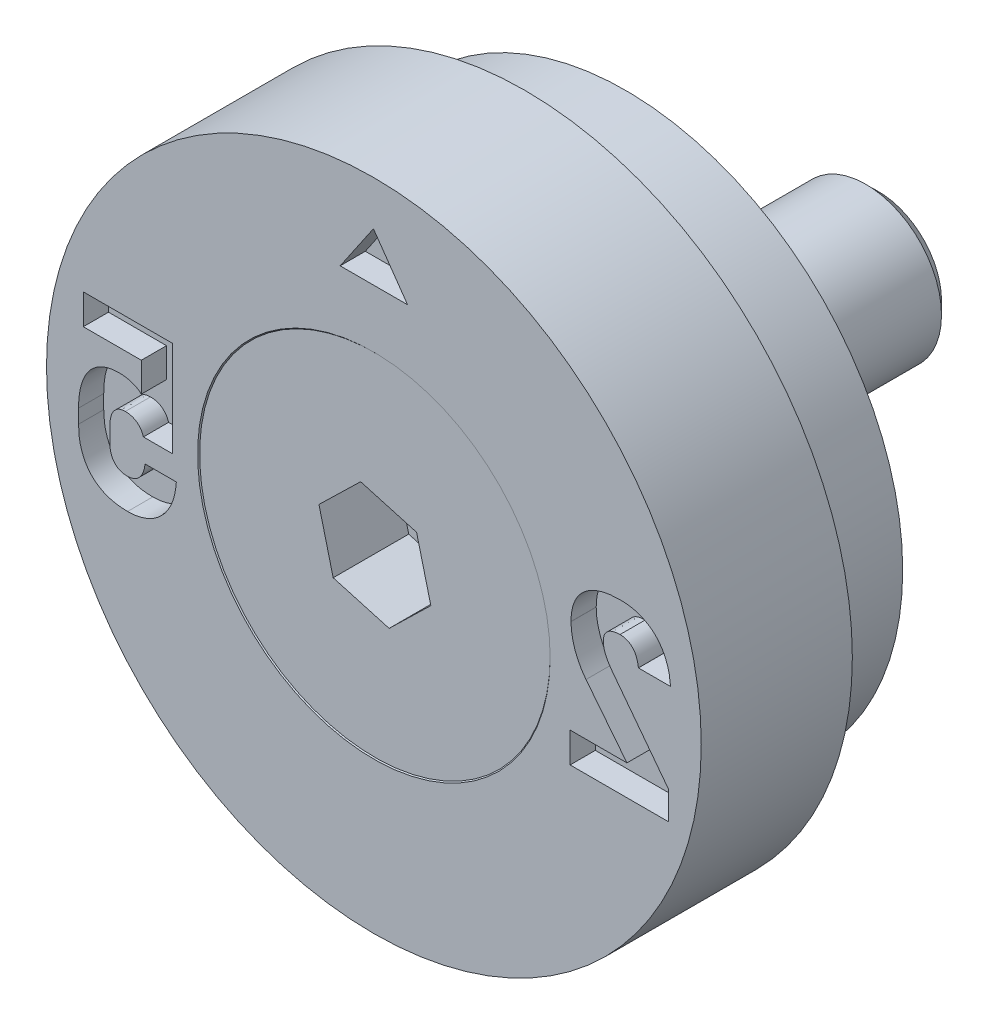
ISO-10303-21;
HEADER;
FILE_DESCRIPTION(('STEP AP214'),'2;1');
FILE_NAME('part.step','',(''),(''),'','','');
FILE_SCHEMA(('AUTOMOTIVE_DESIGN { 1 0 10303 214 1 1 1 1 }'));
ENDSEC;
DATA;
#1=APPLICATION_CONTEXT('core data for automotive mechanical design processes');
#2=APPLICATION_PROTOCOL_DEFINITION('international standard','automotive_design',2000,#1);
#3=PRODUCT_CONTEXT('',#1,'mechanical');
#4=PRODUCT('Part','Part','',(#3));
#5=PRODUCT_RELATED_PRODUCT_CATEGORY('part','',(#4));
#6=PRODUCT_DEFINITION_FORMATION('','',#4);
#7=PRODUCT_DEFINITION_CONTEXT('part definition',#1,'design');
#8=PRODUCT_DEFINITION('design','',#6,#7);
#9=PRODUCT_DEFINITION_SHAPE('','',#8);
#10=(LENGTH_UNIT() NAMED_UNIT(*) SI_UNIT(.MILLI.,.METRE.));
#11=(NAMED_UNIT(*) PLANE_ANGLE_UNIT() SI_UNIT($,.RADIAN.));
#12=(NAMED_UNIT(*) SI_UNIT($,.STERADIAN.) SOLID_ANGLE_UNIT());
#13=UNCERTAINTY_MEASURE_WITH_UNIT(LENGTH_MEASURE(1.E-05),#10,'distance_accuracy_value','');
#14=(GEOMETRIC_REPRESENTATION_CONTEXT(3) GLOBAL_UNCERTAINTY_ASSIGNED_CONTEXT((#13)) GLOBAL_UNIT_ASSIGNED_CONTEXT((#10,
#11,#12)) REPRESENTATION_CONTEXT('',''));
#15=CARTESIAN_POINT('',(0.,0.,0.));
#16=DIRECTION('',(0.,0.,1.));
#17=DIRECTION('',(1.,0.,0.));
#18=AXIS2_PLACEMENT_3D('',#15,#16,#17);
#19=CARTESIAN_POINT('',(0.,0.,-0.0200000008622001));
#20=DIRECTION('',(0.,0.,1.));
#21=DIRECTION('',(1.,0.,0.));
#22=AXIS2_PLACEMENT_3D('',#19,#20,#21);
#23=CYLINDRICAL_SURFACE('',#22,1.5);
#24=CARTESIAN_POINT('',(0.,0.,-2.0000000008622));
#25=DIRECTION('',(0.,0.,1.));
#26=DIRECTION('',(1.,0.,0.));
#27=AXIS2_PLACEMENT_3D('',#24,#25,#26);
#28=CIRCLE('',#27,1.5);
#29=CARTESIAN_POINT('',(1.5,0.,-2.0000000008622));
#30=VERTEX_POINT('',#29);
#31=EDGE_CURVE('E12',#30,#30,#28,.T.);
#32=ORIENTED_EDGE('',*,*,#31,.F.);
#33=EDGE_LOOP('',(#32));
#34=FACE_BOUND('',#33,.T.);
#35=CARTESIAN_POINT('',(0.,0.,-9.7700000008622));
#36=DIRECTION('',(0.,0.,1.));
#37=DIRECTION('',(1.,0.,0.));
#38=AXIS2_PLACEMENT_3D('',#35,#36,#37);
#39=CIRCLE('',#38,1.5);
#40=CARTESIAN_POINT('',(1.5,0.,-9.7700000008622));
#41=VERTEX_POINT('',#40);
#42=EDGE_CURVE('E146',#41,#41,#39,.T.);
#43=ORIENTED_EDGE('',*,*,#42,.T.);
#44=EDGE_LOOP('',(#43));
#45=FACE_BOUND('',#44,.T.);
#46=ADVANCED_FACE('F45',(#34,#45),#23,.T.);
#47=CARTESIAN_POINT('',(0.,0.,-2.0000000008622));
#48=DIRECTION('',(0.,0.,1.));
#49=DIRECTION('',(1.,0.,0.));
#50=AXIS2_PLACEMENT_3D('',#47,#48,#49);
#51=CONICAL_SURFACE('',#50,1.5,0.785398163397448);
#52=CARTESIAN_POINT('',(0.,0.,-0.0200000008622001));
#53=DIRECTION('',(0.,0.,1.));
#54=DIRECTION('',(1.,0.,0.));
#55=AXIS2_PLACEMENT_3D('',#52,#53,#54);
#56=CIRCLE('',#55,3.48);
#57=CARTESIAN_POINT('',(3.48,0.,-0.0200000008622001));
#58=VERTEX_POINT('',#57);
#59=EDGE_CURVE('E52',#58,#58,#56,.T.);
#60=ORIENTED_EDGE('',*,*,#59,.F.);
#61=EDGE_LOOP('',(#60));
#62=FACE_BOUND('',#61,.T.);
#63=ORIENTED_EDGE('',*,*,#31,.T.);
#64=EDGE_LOOP('',(#63));
#65=FACE_BOUND('',#64,.T.);
#66=ADVANCED_FACE('F161',(#62,#65),#51,.T.);
#67=CARTESIAN_POINT('',(0.,3.48,-0.0200000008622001));
#68=DIRECTION('',(0.,0.,-1.));
#69=DIRECTION('',(-1.,0.,0.));
#70=AXIS2_PLACEMENT_3D('',#67,#68,#69);
#71=PLANE('',#70);
#72=DIRECTION('',(0.962144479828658,-0.272539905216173,0.));
#73=VECTOR('',#72,1.);
#74=CARTESIAN_POINT('',(-0.828034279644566,-0.804793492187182,-0.0200000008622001));
#75=LINE('',#74,#73);
#76=CARTESIAN_POINT('',(-0.828034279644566,-0.804793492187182,-0.0200000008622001));
#77=VERTEX_POINT('',#76);
#78=CARTESIAN_POINT('',(0.282954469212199,-1.11949546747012,-0.0200000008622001));
#79=VERTEX_POINT('',#78);
#80=EDGE_CURVE('E133',#77,#79,#75,.T.);
#81=ORIENTED_EDGE('',*,*,#80,.F.);
#82=DIRECTION('',(0.245045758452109,-0.969511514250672,0.));
#83=VECTOR('',#82,1.);
#84=CARTESIAN_POINT('',(-1.11098874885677,0.314701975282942,-0.0200000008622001));
#85=LINE('',#84,#83);
#86=CARTESIAN_POINT('',(-1.11098874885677,0.314701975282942,-0.0200000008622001));
#87=VERTEX_POINT('',#86);
#88=EDGE_CURVE('E59',#87,#77,#85,.T.);
#89=ORIENTED_EDGE('',*,*,#88,.F.);
#90=DIRECTION('',(-0.717098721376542,-0.696971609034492,0.));
#91=VECTOR('',#90,1.);
#92=CARTESIAN_POINT('',(-0.282954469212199,1.11949546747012,-0.0200000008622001));
#93=LINE('',#92,#91);
#94=CARTESIAN_POINT('',(-0.282954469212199,1.11949546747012,-0.0200000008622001));
#95=VERTEX_POINT('',#94);
#96=EDGE_CURVE('E142',#95,#87,#93,.T.);
#97=ORIENTED_EDGE('',*,*,#96,.F.);
#98=DIRECTION('',(-0.962144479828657,0.272539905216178,0.));
#99=VECTOR('',#98,1.);
#100=CARTESIAN_POINT('',(0.828034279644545,0.804793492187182,-0.0200000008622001));
#101=LINE('',#100,#99);
#102=CARTESIAN_POINT('',(0.828034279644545,0.804793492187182,-0.0200000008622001));
#103=VERTEX_POINT('',#102);
#104=EDGE_CURVE('E140',#103,#95,#101,.T.);
#105=ORIENTED_EDGE('',*,*,#104,.F.);
#106=DIRECTION('',(-0.245045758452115,0.96951151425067,0.));
#107=VECTOR('',#106,1.);
#108=CARTESIAN_POINT('',(1.11098874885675,-0.314701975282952,-0.0200000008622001));
#109=LINE('',#108,#107);
#110=CARTESIAN_POINT('',(1.11098874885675,-0.314701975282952,-0.0200000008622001));
#111=VERTEX_POINT('',#110);
#112=EDGE_CURVE('E107',#111,#103,#109,.T.);
#113=ORIENTED_EDGE('',*,*,#112,.F.);
#114=DIRECTION('',(0.717098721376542,0.696971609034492,0.));
#115=VECTOR('',#114,1.);
#116=CARTESIAN_POINT('',(0.282954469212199,-1.11949546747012,-0.0200000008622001));
#117=LINE('',#116,#115);
#118=EDGE_CURVE('E136',#79,#111,#117,.T.);
#119=ORIENTED_EDGE('',*,*,#118,.F.);
#120=EDGE_LOOP('',(#81,#89,#97,#105,#113,#119));
#121=FACE_BOUND('',#120,.T.);
#122=ORIENTED_EDGE('',*,*,#59,.T.);
#123=EDGE_LOOP('',(#122));
#124=FACE_BOUND('',#123,.T.);
#125=ADVANCED_FACE('F159',(#121,#124),#71,.F.);
#126=CARTESIAN_POINT('',(0.,0.,-10.0200000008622));
#127=DIRECTION('',(0.,0.,1.));
#128=DIRECTION('',(1.,0.,0.));
#129=AXIS2_PLACEMENT_3D('',#126,#127,#128);
#130=PLANE('',#129);
#131=CARTESIAN_POINT('',(0.,0.,-10.0200000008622));
#132=DIRECTION('',(0.,0.,1.));
#133=DIRECTION('',(1.,0.,0.));
#134=AXIS2_PLACEMENT_3D('',#131,#132,#133);
#135=CIRCLE('',#134,1.25);
#136=CARTESIAN_POINT('',(1.25,0.,-10.0200000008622));
#137=VERTEX_POINT('',#136);
#138=EDGE_CURVE('E154',#137,#137,#135,.T.);
#139=ORIENTED_EDGE('',*,*,#138,.F.);
#140=EDGE_LOOP('',(#139));
#141=FACE_BOUND('',#140,.T.);
#142=ADVANCED_FACE('F174',(#141),#130,.F.);
#143=CARTESIAN_POINT('',(0.,0.,-10.0200000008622));
#144=DIRECTION('',(0.,0.,1.));
#145=DIRECTION('',(1.,0.,0.));
#146=AXIS2_PLACEMENT_3D('',#143,#144,#145);
#147=CONICAL_SURFACE('',#146,1.25,0.78539816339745);
#148=ORIENTED_EDGE('',*,*,#42,.F.);
#149=EDGE_LOOP('',(#148));
#150=FACE_BOUND('',#149,.T.);
#151=ORIENTED_EDGE('',*,*,#138,.T.);
#152=EDGE_LOOP('',(#151));
#153=FACE_BOUND('',#152,.T.);
#154=ADVANCED_FACE('F170',(#150,#153),#147,.T.);
#155=CARTESIAN_POINT('',(-1.11098874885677,0.314701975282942,-1.5200000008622));
#156=DIRECTION('',(-0.969511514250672,-0.245045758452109,0.));
#157=DIRECTION('',(0.245045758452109,-0.969511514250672,0.));
#158=AXIS2_PLACEMENT_3D('',#155,#156,#157);
#159=PLANE('',#158);
#160=ORIENTED_EDGE('',*,*,#88,.T.);
#161=DIRECTION('',(0.,0.,1.));
#162=VECTOR('',#161,1.);
#163=CARTESIAN_POINT('',(-0.828034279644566,-0.804793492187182,-1.5200000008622));
#164=LINE('',#163,#162);
#165=CARTESIAN_POINT('',(-0.828034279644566,-0.804793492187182,-1.5200000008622));
#166=VERTEX_POINT('',#165);
#167=EDGE_CURVE('E89',#166,#77,#164,.T.);
#168=ORIENTED_EDGE('',*,*,#167,.F.);
#169=DIRECTION('',(0.245045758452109,-0.969511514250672,0.));
#170=VECTOR('',#169,1.);
#171=CARTESIAN_POINT('',(-1.11098874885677,0.314701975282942,-1.5200000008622));
#172=LINE('',#171,#170);
#173=CARTESIAN_POINT('',(-1.11098874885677,0.314701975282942,-1.5200000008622));
#174=VERTEX_POINT('',#173);
#175=EDGE_CURVE('E144',#174,#166,#172,.T.);
#176=ORIENTED_EDGE('',*,*,#175,.F.);
#177=DIRECTION('',(0.,0.,1.));
#178=VECTOR('',#177,1.);
#179=CARTESIAN_POINT('',(-1.11098874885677,0.314701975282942,-1.5200000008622));
#180=LINE('',#179,#178);
#181=EDGE_CURVE('E67',#174,#87,#180,.T.);
#182=ORIENTED_EDGE('',*,*,#181,.T.);
#183=EDGE_LOOP('',(#160,#168,#176,#182));
#184=FACE_BOUND('',#183,.T.);
#185=ADVANCED_FACE('F173',(#184),#159,.F.);
#186=CARTESIAN_POINT('',(-0.282954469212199,1.11949546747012,-1.5200000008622));
#187=DIRECTION('',(-0.696971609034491,0.717098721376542,0.));
#188=DIRECTION('',(-0.717098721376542,-0.696971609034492,0.));
#189=AXIS2_PLACEMENT_3D('',#186,#187,#188);
#190=PLANE('',#189);
#191=ORIENTED_EDGE('',*,*,#96,.T.);
#192=ORIENTED_EDGE('',*,*,#181,.F.);
#193=DIRECTION('',(-0.717098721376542,-0.696971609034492,0.));
#194=VECTOR('',#193,1.);
#195=CARTESIAN_POINT('',(-0.282954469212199,1.11949546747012,-1.5200000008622));
#196=LINE('',#195,#194);
#197=CARTESIAN_POINT('',(-0.282954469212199,1.11949546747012,-1.5200000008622));
#198=VERTEX_POINT('',#197);
#199=EDGE_CURVE('E119',#198,#174,#196,.T.);
#200=ORIENTED_EDGE('',*,*,#199,.F.);
#201=DIRECTION('',(0.,0.,1.));
#202=VECTOR('',#201,1.);
#203=CARTESIAN_POINT('',(-0.282954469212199,1.11949546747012,-1.5200000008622));
#204=LINE('',#203,#202);
#205=EDGE_CURVE('E111',#198,#95,#204,.T.);
#206=ORIENTED_EDGE('',*,*,#205,.T.);
#207=EDGE_LOOP('',(#191,#192,#200,#206));
#208=FACE_BOUND('',#207,.T.);
#209=ADVANCED_FACE('F189',(#208),#190,.F.);
#210=CARTESIAN_POINT('',(0.828034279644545,0.804793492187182,-1.5200000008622));
#211=DIRECTION('',(0.272539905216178,0.962144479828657,0.));
#212=DIRECTION('',(-0.962144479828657,0.272539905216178,0.));
#213=AXIS2_PLACEMENT_3D('',#210,#211,#212);
#214=PLANE('',#213);
#215=ORIENTED_EDGE('',*,*,#104,.T.);
#216=ORIENTED_EDGE('',*,*,#205,.F.);
#217=DIRECTION('',(-0.962144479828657,0.272539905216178,0.));
#218=VECTOR('',#217,1.);
#219=CARTESIAN_POINT('',(0.828034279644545,0.804793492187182,-1.5200000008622));
#220=LINE('',#219,#218);
#221=CARTESIAN_POINT('',(0.828034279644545,0.804793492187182,-1.5200000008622));
#222=VERTEX_POINT('',#221);
#223=EDGE_CURVE('E115',#222,#198,#220,.T.);
#224=ORIENTED_EDGE('',*,*,#223,.F.);
#225=DIRECTION('',(0.,0.,1.));
#226=VECTOR('',#225,1.);
#227=CARTESIAN_POINT('',(0.828034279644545,0.804793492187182,-1.5200000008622));
#228=LINE('',#227,#226);
#229=EDGE_CURVE('E100',#222,#103,#228,.T.);
#230=ORIENTED_EDGE('',*,*,#229,.T.);
#231=EDGE_LOOP('',(#215,#216,#224,#230));
#232=FACE_BOUND('',#231,.T.);
#233=ADVANCED_FACE('F116',(#232),#214,.F.);
#234=CARTESIAN_POINT('',(1.11098874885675,-0.314701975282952,-1.5200000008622));
#235=DIRECTION('',(0.96951151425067,0.245045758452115,0.));
#236=DIRECTION('',(-0.245045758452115,0.96951151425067,0.));
#237=AXIS2_PLACEMENT_3D('',#234,#235,#236);
#238=PLANE('',#237);
#239=ORIENTED_EDGE('',*,*,#112,.T.);
#240=ORIENTED_EDGE('',*,*,#229,.F.);
#241=DIRECTION('',(-0.245045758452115,0.96951151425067,0.));
#242=VECTOR('',#241,1.);
#243=CARTESIAN_POINT('',(1.11098874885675,-0.314701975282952,-1.5200000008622));
#244=LINE('',#243,#242);
#245=CARTESIAN_POINT('',(1.11098874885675,-0.314701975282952,-1.5200000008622));
#246=VERTEX_POINT('',#245);
#247=EDGE_CURVE('E104',#246,#222,#244,.T.);
#248=ORIENTED_EDGE('',*,*,#247,.F.);
#249=DIRECTION('',(0.,0.,1.));
#250=VECTOR('',#249,1.);
#251=CARTESIAN_POINT('',(1.11098874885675,-0.314701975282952,-1.5200000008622));
#252=LINE('',#251,#250);
#253=EDGE_CURVE('E112',#246,#111,#252,.T.);
#254=ORIENTED_EDGE('',*,*,#253,.T.);
#255=EDGE_LOOP('',(#239,#240,#248,#254));
#256=FACE_BOUND('',#255,.T.);
#257=ADVANCED_FACE('F102',(#256),#238,.F.);
#258=CARTESIAN_POINT('',(0.282954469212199,-1.11949546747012,-1.5200000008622));
#259=DIRECTION('',(0.696971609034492,-0.717098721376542,0.));
#260=DIRECTION('',(0.717098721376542,0.696971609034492,0.));
#261=AXIS2_PLACEMENT_3D('',#258,#259,#260);
#262=PLANE('',#261);
#263=ORIENTED_EDGE('',*,*,#118,.T.);
#264=ORIENTED_EDGE('',*,*,#253,.F.);
#265=DIRECTION('',(0.717098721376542,0.696971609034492,0.));
#266=VECTOR('',#265,1.);
#267=CARTESIAN_POINT('',(0.282954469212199,-1.11949546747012,-1.5200000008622));
#268=LINE('',#267,#266);
#269=CARTESIAN_POINT('',(0.282954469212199,-1.11949546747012,-1.5200000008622));
#270=VERTEX_POINT('',#269);
#271=EDGE_CURVE('E125',#270,#246,#268,.T.);
#272=ORIENTED_EDGE('',*,*,#271,.F.);
#273=DIRECTION('',(0.,0.,1.));
#274=VECTOR('',#273,1.);
#275=CARTESIAN_POINT('',(0.282954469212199,-1.11949546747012,-1.5200000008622));
#276=LINE('',#275,#274);
#277=EDGE_CURVE('E149',#270,#79,#276,.T.);
#278=ORIENTED_EDGE('',*,*,#277,.T.);
#279=EDGE_LOOP('',(#263,#264,#272,#278));
#280=FACE_BOUND('',#279,.T.);
#281=ADVANCED_FACE('F193',(#280),#262,.F.);
#282=CARTESIAN_POINT('',(-0.828034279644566,-0.804793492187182,-1.5200000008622));
#283=DIRECTION('',(-0.272539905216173,-0.962144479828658,0.));
#284=DIRECTION('',(0.962144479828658,-0.272539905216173,0.));
#285=AXIS2_PLACEMENT_3D('',#282,#283,#284);
#286=PLANE('',#285);
#287=ORIENTED_EDGE('',*,*,#80,.T.);
#288=ORIENTED_EDGE('',*,*,#277,.F.);
#289=DIRECTION('',(0.962144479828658,-0.272539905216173,0.));
#290=VECTOR('',#289,1.);
#291=CARTESIAN_POINT('',(-0.828034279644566,-0.804793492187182,-1.5200000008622));
#292=LINE('',#291,#290);
#293=EDGE_CURVE('E127',#166,#270,#292,.T.);
#294=ORIENTED_EDGE('',*,*,#293,.F.);
#295=ORIENTED_EDGE('',*,*,#167,.T.);
#296=EDGE_LOOP('',(#287,#288,#294,#295));
#297=FACE_BOUND('',#296,.T.);
#298=ADVANCED_FACE('F190',(#297),#286,.F.);
#299=CARTESIAN_POINT('',(0.,0.,-1.5200000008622));
#300=DIRECTION('',(0.,0.,1.));
#301=DIRECTION('',(1.,0.,0.));
#302=AXIS2_PLACEMENT_3D('',#299,#300,#301);
#303=PLANE('',#302);
#304=ORIENTED_EDGE('',*,*,#175,.T.);
#305=ORIENTED_EDGE('',*,*,#293,.T.);
#306=ORIENTED_EDGE('',*,*,#271,.T.);
#307=ORIENTED_EDGE('',*,*,#247,.T.);
#308=ORIENTED_EDGE('',*,*,#223,.T.);
#309=ORIENTED_EDGE('',*,*,#199,.T.);
#310=EDGE_LOOP('',(#304,#305,#306,#307,#308,#309));
#311=FACE_BOUND('',#310,.T.);
#312=ADVANCED_FACE('F122',(#311),#303,.T.);
#313=CLOSED_SHELL('',(#46,#66,#125,#142,#154,#185,#209,#233,#257,#281,#298,#312));
#314=MANIFOLD_SOLID_BREP('B2',#313);
#315=CARTESIAN_POINT('',(0.,0.,3.12219627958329));
#316=DIRECTION('',(0.,0.,1.));
#317=DIRECTION('',(1.,0.,0.));
#318=AXIS2_PLACEMENT_3D('',#315,#316,#317);
#319=CYLINDRICAL_SURFACE('',#318,6.5);
#320=CARTESIAN_POINT('',(0.,0.,0.));
#321=DIRECTION('',(0.,0.,1.));
#322=DIRECTION('',(1.,0.,0.));
#323=AXIS2_PLACEMENT_3D('',#320,#321,#322);
#324=CIRCLE('',#323,6.5);
#325=CARTESIAN_POINT('',(6.5,0.,0.));
#326=VERTEX_POINT('',#325);
#327=EDGE_CURVE('E43',#326,#326,#324,.T.);
#328=ORIENTED_EDGE('',*,*,#327,.F.);
#329=EDGE_LOOP('',(#328));
#330=FACE_BOUND('',#329,.T.);
#331=CARTESIAN_POINT('',(0.,0.,-3.));
#332=DIRECTION('',(0.,0.,1.));
#333=DIRECTION('',(1.,0.,0.));
#334=AXIS2_PLACEMENT_3D('',#331,#332,#333);
#335=CIRCLE('',#334,6.5);
#336=CARTESIAN_POINT('',(6.5,0.,-3.));
#337=VERTEX_POINT('',#336);
#338=EDGE_CURVE('E745',#337,#337,#335,.T.);
#339=ORIENTED_EDGE('',*,*,#338,.T.);
#340=EDGE_LOOP('',(#339));
#341=FACE_BOUND('',#340,.T.);
#342=ADVANCED_FACE('F256',(#330,#341),#319,.T.);
#343=CARTESIAN_POINT('',(0.,6.5,0.));
#344=DIRECTION('',(0.,0.,-1.));
#345=DIRECTION('',(-1.,0.,0.));
#346=AXIS2_PLACEMENT_3D('',#343,#344,#345);
#347=PLANE('',#346);
#348=DIRECTION('',(-0.60539313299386,0.795926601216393,0.));
#349=VECTOR('',#348,1.);
#350=CARTESIAN_POINT('',(5.84899713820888,-1.089787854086,0.));
#351=LINE('',#350,#349);
#352=CARTESIAN_POINT('',(5.84899713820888,-1.089787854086,0.));
#353=VERTEX_POINT('',#352);
#354=CARTESIAN_POINT('',(4.71580618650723,0.400048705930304,0.));
#355=VERTEX_POINT('',#354);
#356=EDGE_CURVE('E1207',#353,#355,#351,.T.);
#357=ORIENTED_EDGE('',*,*,#356,.F.);
#358=DIRECTION('',(0.,1.,0.));
#359=VECTOR('',#358,1.);
#360=CARTESIAN_POINT('',(5.84899713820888,-1.651,0.));
#361=LINE('',#360,#359);
#362=CARTESIAN_POINT('',(5.84899713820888,-1.651,0.));
#363=VERTEX_POINT('',#362);
#364=EDGE_CURVE('E270',#363,#353,#361,.T.);
#365=ORIENTED_EDGE('',*,*,#364,.F.);
#366=DIRECTION('',(1.,0.,0.));
#367=VECTOR('',#366,1.);
#368=CARTESIAN_POINT('',(3.89619420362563,-1.651,0.));
#369=LINE('',#368,#367);
#370=CARTESIAN_POINT('',(3.89619420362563,-1.651,0.));
#371=VERTEX_POINT('',#370);
#372=EDGE_CURVE('E527',#371,#363,#369,.T.);
#373=ORIENTED_EDGE('',*,*,#372,.F.);
#374=DIRECTION('',(0.,-1.,0.));
#375=VECTOR('',#374,1.);
#376=CARTESIAN_POINT('',(3.89619420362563,-1.05143162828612,0.));
#377=LINE('',#376,#375);
#378=CARTESIAN_POINT('',(3.89619420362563,-1.05143162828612,0.));
#379=VERTEX_POINT('',#378);
#380=EDGE_CURVE('E530',#379,#371,#377,.T.);
#381=ORIENTED_EDGE('',*,*,#380,.F.);
#382=DIRECTION('',(-1.,0.,0.));
#383=VECTOR('',#382,1.);
#384=CARTESIAN_POINT('',(5.02467474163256,-1.05143162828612,0.));
#385=LINE('',#384,#383);
#386=CARTESIAN_POINT('',(5.02467474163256,-1.05143162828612,0.));
#387=VERTEX_POINT('',#386);
#388=EDGE_CURVE('E1275',#387,#379,#385,.T.);
#389=ORIENTED_EDGE('',*,*,#388,.F.);
#390=DIRECTION('',(0.620676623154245,-0.78406666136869,0.));
#391=VECTOR('',#390,1.);
#392=CARTESIAN_POINT('',(4.21179192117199,-0.0245614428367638,0.));
#393=LINE('',#392,#391);
#394=CARTESIAN_POINT('',(4.21179192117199,-0.0245614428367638,0.));
#395=VERTEX_POINT('',#394);
#396=EDGE_CURVE('E1269',#395,#387,#393,.T.);
#397=ORIENTED_EDGE('',*,*,#396,.F.);
#398=CARTESIAN_POINT('',(3.91436294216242,0.821967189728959,0.));
#399=CARTESIAN_POINT('',(3.915225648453,0.78446086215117,0.));
#400=CARTESIAN_POINT('',(3.91695263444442,0.709379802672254,0.));
#401=CARTESIAN_POINT('',(3.93235511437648,0.597211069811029,0.));
#402=CARTESIAN_POINT('',(3.95754045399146,0.48569042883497,0.));
#403=CARTESIAN_POINT('',(3.99171356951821,0.375208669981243,0.));
#404=CARTESIAN_POINT('',(4.03438633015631,0.267610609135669,0.));
#405=CARTESIAN_POINT('',(4.08531333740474,0.164610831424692,0.));
#406=CARTESIAN_POINT('',(4.14345660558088,0.0664722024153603,0.));
#407=CARTESIAN_POINT('',(4.18901667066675,0.00577885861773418,0.));
#408=CARTESIAN_POINT('',(4.21179192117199,-0.0245614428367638,0.));
#409=B_SPLINE_CURVE_WITH_KNOTS('',3,(#398,#399,#400,#401,#402,#403,#404,#405,#406,#407,#408),
.UNSPECIFIED.,.F.,.F.,(4,1,1,1,1,1,1,1,4),(0.,0.123148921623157,0.24652244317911,
0.371108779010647,0.498350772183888,0.625999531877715,0.750879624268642,0.875465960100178,1.),.UNSPECIFIED.);
#410=CARTESIAN_POINT('',(3.91436294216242,0.821967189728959,0.));
#411=VERTEX_POINT('',#410);
#412=EDGE_CURVE('E1264',#411,#395,#409,.T.);
#413=ORIENTED_EDGE('',*,*,#412,.F.);
#414=DIRECTION('',(0.,-1.,0.));
#415=VECTOR('',#414,1.);
#416=CARTESIAN_POINT('',(3.91436294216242,0.824658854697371,0.));
#417=LINE('',#416,#415);
#418=CARTESIAN_POINT('',(3.91436294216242,0.824658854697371,0.));
#419=VERTEX_POINT('',#418);
#420=EDGE_CURVE('E1258',#419,#411,#417,.T.);
#421=ORIENTED_EDGE('',*,*,#420,.F.);
#422=CARTESIAN_POINT('',(4.89076440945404,1.68531872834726,0.));
#423=CARTESIAN_POINT('',(4.84113114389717,1.68428113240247,0.));
#424=CARTESIAN_POINT('',(4.74506898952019,1.68227292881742,0.));
#425=CARTESIAN_POINT('',(4.60674593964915,1.66336798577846,0.));
#426=CARTESIAN_POINT('',(4.47955550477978,1.6319079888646,0.));
#427=CARTESIAN_POINT('',(4.36381677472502,1.58770793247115,0.));
#428=CARTESIAN_POINT('',(4.26028975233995,1.5308898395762,0.));
#429=CARTESIAN_POINT('',(4.16849530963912,1.46344771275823,0.));
#430=CARTESIAN_POINT('',(4.09102524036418,1.38276344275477,0.));
#431=CARTESIAN_POINT('',(4.0265854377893,1.29110490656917,0.));
#432=CARTESIAN_POINT('',(3.97578711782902,1.18882578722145,0.));
#433=CARTESIAN_POINT('',(3.94021322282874,1.07601429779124,0.));
#434=CARTESIAN_POINT('',(3.91842753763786,0.953576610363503,0.));
#435=CARTESIAN_POINT('',(3.91574493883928,0.868491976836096,0.));
#436=CARTESIAN_POINT('',(3.91436294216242,0.824658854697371,0.));
#437=B_SPLINE_CURVE_WITH_KNOTS('',3,(#422,#423,#424,#425,#426,#427,#428,#429,#430,#431,#432,
#433,#434,#435,#436),.UNSPECIFIED.,.F.,.F.,(4,1,1,1,1,1,1,1,1,1,1,1,4),(0.,0.100715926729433,
0.194929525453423,0.2827284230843,0.366191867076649,0.445669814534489,0.521804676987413,
0.596515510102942,0.671682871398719,0.748455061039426,0.827368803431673,0.911065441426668,1.),.UNSPECIFIED.);
#438=CARTESIAN_POINT('',(4.89076440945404,1.68531872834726,0.));
#439=VERTEX_POINT('',#438);
#440=EDGE_CURVE('E1250',#439,#419,#437,.T.);
#441=ORIENTED_EDGE('',*,*,#440,.F.);
#442=CARTESIAN_POINT('',(5.89004502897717,0.697477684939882,0.));
#443=CARTESIAN_POINT('',(5.88547423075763,0.747188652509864,0.));
#444=CARTESIAN_POINT('',(5.87657003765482,0.844028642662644,0.));
#445=CARTESIAN_POINT('',(5.84629326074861,0.983292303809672,0.));
#446=CARTESIAN_POINT('',(5.80156567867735,1.11143576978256,0.));
#447=CARTESIAN_POINT('',(5.74441998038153,1.22881273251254,0.));
#448=CARTESIAN_POINT('',(5.67434938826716,1.33394141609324,0.));
#449=CARTESIAN_POINT('',(5.59304665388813,1.42679347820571,0.));
#450=CARTESIAN_POINT('',(5.49961129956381,1.50556538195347,0.));
#451=CARTESIAN_POINT('',(5.39566175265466,1.57102180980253,0.));
#452=CARTESIAN_POINT('',(5.28165204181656,1.62224809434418,0.));
#453=CARTESIAN_POINT('',(5.15897644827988,1.65957201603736,0.));
#454=CARTESIAN_POINT('',(5.02745020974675,1.68108884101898,0.));
#455=CARTESIAN_POINT('',(4.93704970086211,1.68388638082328,0.));
#456=CARTESIAN_POINT('',(4.89076440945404,1.68531872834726,0.));
#457=B_SPLINE_CURVE_WITH_KNOTS('',3,(#442,#443,#444,#445,#446,#447,#448,#449,#450,#451,#452,
#453,#454,#455,#456),.UNSPECIFIED.,.F.,.F.,(4,1,1,1,1,1,1,1,1,1,1,1,4),(0.,0.0953291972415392,
0.185707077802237,0.271513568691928,0.35413169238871,0.434493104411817,0.512233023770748,
0.58917600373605,0.667186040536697,0.746219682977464,0.827302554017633,0.911578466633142,1.),.UNSPECIFIED.);
#458=CARTESIAN_POINT('',(5.89004502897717,0.697477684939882,0.));
#459=VERTEX_POINT('',#458);
#460=EDGE_CURVE('E1245',#459,#439,#457,.T.);
#461=ORIENTED_EDGE('',*,*,#460,.F.);
#462=DIRECTION('',(0.,1.,0.));
#463=VECTOR('',#462,1.);
#464=CARTESIAN_POINT('',(5.89004502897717,0.694786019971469,0.));
#465=LINE('',#464,#463);
#466=CARTESIAN_POINT('',(5.89004502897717,0.694786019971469,0.));
#467=VERTEX_POINT('',#466);
#468=EDGE_CURVE('E1242',#467,#459,#465,.T.);
#469=ORIENTED_EDGE('',*,*,#468,.F.);
#470=DIRECTION('',(1.,0.,0.));
#471=VECTOR('',#470,1.);
#472=CARTESIAN_POINT('',(5.25212043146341,0.694786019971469,0.));
#473=LINE('',#472,#471);
#474=CARTESIAN_POINT('',(5.25212043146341,0.694786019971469,0.));
#475=VERTEX_POINT('',#474);
#476=EDGE_CURVE('E1239',#475,#467,#473,.T.);
#477=ORIENTED_EDGE('',*,*,#476,.F.);
#478=DIRECTION('',(0.,-1.,0.));
#479=VECTOR('',#478,1.);
#480=CARTESIAN_POINT('',(5.25212043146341,0.697477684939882,0.));
#481=LINE('',#480,#479);
#482=CARTESIAN_POINT('',(5.25212043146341,0.697477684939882,0.));
#483=VERTEX_POINT('',#482);
#484=EDGE_CURVE('E1233',#483,#475,#481,.T.);
#485=ORIENTED_EDGE('',*,*,#484,.F.);
#486=CARTESIAN_POINT('',(4.88605399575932,1.08575035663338,0.));
#487=CARTESIAN_POINT('',(4.91062815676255,1.0847123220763,0.));
#488=CARTESIAN_POINT('',(4.95831882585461,1.08269782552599,0.));
#489=CARTESIAN_POINT('',(5.02615915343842,1.06350169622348,0.));
#490=CARTESIAN_POINT('',(5.08642401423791,1.03091217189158,0.));
#491=CARTESIAN_POINT('',(5.1385930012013,0.985872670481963,0.));
#492=CARTESIAN_POINT('',(5.18236750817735,0.92921288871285,0.));
#493=CARTESIAN_POINT('',(5.21463257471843,0.860956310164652,0.));
#494=CARTESIAN_POINT('',(5.24061616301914,0.783379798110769,0.));
#495=CARTESIAN_POINT('',(5.24815656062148,0.727075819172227,0.));
#496=CARTESIAN_POINT('',(5.25212043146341,0.697477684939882,0.));
#497=B_SPLINE_CURVE_WITH_KNOTS('',3,(#486,#487,#488,#489,#490,#491,#492,#493,#494,#495,#496),
.UNSPECIFIED.,.F.,.F.,(4,1,1,1,1,1,1,1,4),(0.,0.124212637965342,0.241057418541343,
0.353359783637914,0.468536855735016,0.587568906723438,0.713021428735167,0.849139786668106,1.),.UNSPECIFIED.);
#498=CARTESIAN_POINT('',(4.88605399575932,1.08575035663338,0.));
#499=VERTEX_POINT('',#498);
#500=EDGE_CURVE('E1225',#499,#483,#497,.T.);
#501=ORIENTED_EDGE('',*,*,#500,.F.);
#502=CARTESIAN_POINT('',(4.55497920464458,0.806490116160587,0.));
#503=CARTESIAN_POINT('',(4.55588227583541,0.827693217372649,0.));
#504=CARTESIAN_POINT('',(4.55760322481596,0.868099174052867,0.));
#505=CARTESIAN_POINT('',(4.57421742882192,0.924946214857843,0.));
#506=CARTESIAN_POINT('',(4.6016907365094,0.97410337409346,0.));
#507=CARTESIAN_POINT('',(4.64017339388,1.01531101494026,0.));
#508=CARTESIAN_POINT('',(4.68912357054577,1.04698099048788,0.));
#509=CARTESIAN_POINT('',(4.74686340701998,1.0701156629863,0.));
#510=CARTESIAN_POINT('',(4.81369974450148,1.08320554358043,0.));
#511=CARTESIAN_POINT('',(4.86109818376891,1.08487262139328,0.));
#512=CARTESIAN_POINT('',(4.88605399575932,1.08575035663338,0.));
#513=B_SPLINE_CURVE_WITH_KNOTS('',3,(#502,#503,#504,#505,#506,#507,#508,#509,#510,#511,#512),
.UNSPECIFIED.,.F.,.F.,(4,1,1,1,1,1,1,1,4),(0.,0.129170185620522,0.246154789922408,
0.35773418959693,0.470108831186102,0.586692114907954,0.710769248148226,0.847716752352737,1.),.UNSPECIFIED.);
#514=CARTESIAN_POINT('',(4.55497920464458,0.806490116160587,0.));
#515=VERTEX_POINT('',#514);
#516=EDGE_CURVE('E1220',#515,#499,#513,.T.);
#517=ORIENTED_EDGE('',*,*,#516,.F.);
#518=DIRECTION('',(0.,1.,0.));
#519=VECTOR('',#518,1.);
#520=CARTESIAN_POINT('',(4.55497920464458,0.801779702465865,0.));
#521=LINE('',#520,#519);
#522=CARTESIAN_POINT('',(4.55497920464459,0.801779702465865,0.));
#523=VERTEX_POINT('',#522);
#524=EDGE_CURVE('E1214',#523,#515,#521,.T.);
#525=ORIENTED_EDGE('',*,*,#524,.F.);
#526=CARTESIAN_POINT('',(4.71580618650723,0.400048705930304,0.));
#527=CARTESIAN_POINT('',(4.69204009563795,0.433021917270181,0.));
#528=CARTESIAN_POINT('',(4.64564374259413,0.497392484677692,0.));
#529=CARTESIAN_POINT('',(4.60413334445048,0.586177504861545,0.));
#530=CARTESIAN_POINT('',(4.57776314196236,0.655794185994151,0.));
#531=CARTESIAN_POINT('',(4.5655716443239,0.706292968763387,0.));
#532=CARTESIAN_POINT('',(4.55654656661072,0.754581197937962,0.));
#533=CARTESIAN_POINT('',(4.55549447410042,0.786263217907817,0.));
#534=CARTESIAN_POINT('',(4.55497920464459,0.801779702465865,0.));
#535=B_SPLINE_CURVE_WITH_KNOTS('',3,(#526,#527,#528,#529,#530,#531,#532,#533,#534),
.UNSPECIFIED.,.F.,.F.,(4,1,1,1,1,1,4),(0.,0.27673722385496,0.540248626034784,0.66563356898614,
0.784034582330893,0.894229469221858,1.),.UNSPECIFIED.);
#536=EDGE_CURVE('E1209',#355,#523,#535,.T.);
#537=ORIENTED_EDGE('',*,*,#536,.F.);
#538=EDGE_LOOP('',(#357,#365,#373,#381,#389,#397,#413,#421,#441,#461,#469,#477,#485,#501,#517,
#525,#537));
#539=FACE_BOUND('',#538,.T.);
#540=CARTESIAN_POINT('',(-4.88988475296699,-1.68531872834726,0.));
#541=CARTESIAN_POINT('',(-4.84648660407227,-1.68399471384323,0.));
#542=CARTESIAN_POINT('',(-4.76156387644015,-1.68140384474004,0.));
#543=CARTESIAN_POINT('',(-4.63777673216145,-1.65814497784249,0.));
#544=CARTESIAN_POINT('',(-4.52042249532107,-1.62212440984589,0.));
#545=CARTESIAN_POINT('',(-4.41037381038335,-1.57073861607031,0.));
#546=CARTESIAN_POINT('',(-4.3088264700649,-1.50545449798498,0.));
#547=CARTESIAN_POINT('',(-4.21802547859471,-1.42562327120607,0.));
#548=CARTESIAN_POINT('',(-4.13713798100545,-1.3333350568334,0.));
#549=CARTESIAN_POINT('',(-4.06778597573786,-1.22778199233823,0.));
#550=CARTESIAN_POINT('',(-4.0106718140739,-1.11009327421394,0.));
#551=CARTESIAN_POINT('',(-3.96620744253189,-0.981655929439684,0.));
#552=CARTESIAN_POINT('',(-3.93566756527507,-0.842700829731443,0.));
#553=CARTESIAN_POINT('',(-3.9267891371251,-0.74629623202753,0.));
#554=CARTESIAN_POINT('',(-3.92223119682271,-0.696804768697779,0.));
#555=B_SPLINE_CURVE_WITH_KNOTS('',3,(#540,#541,#542,#543,#544,#545,#546,#547,#548,#549,#550,
#551,#552,#553,#554),.UNSPECIFIED.,.F.,.F.,(4,1,1,1,1,1,1,1,1,1,1,1,4),(0.,0.0844304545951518,
0.165215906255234,0.244369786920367,0.322918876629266,0.40093676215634,0.47863123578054,
0.557558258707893,0.63920335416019,0.723781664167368,0.811629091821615,0.903295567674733,1.),.UNSPECIFIED.);
#556=CARTESIAN_POINT('',(-4.88988475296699,-1.68531872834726,0.));
#557=VERTEX_POINT('',#556);
#558=CARTESIAN_POINT('',(-3.92223119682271,-0.696804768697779,0.));
#559=VERTEX_POINT('',#558);
#560=EDGE_CURVE('E594',#557,#559,#555,.T.);
#561=ORIENTED_EDGE('',*,*,#560,.F.);
#562=CARTESIAN_POINT('',(-5.8635945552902,-0.671906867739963,0.));
#563=CARTESIAN_POINT('',(-5.86212048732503,-0.723334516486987,0.));
#564=CARTESIAN_POINT('',(-5.85926885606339,-0.822822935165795,0.));
#565=CARTESIAN_POINT('',(-5.83887670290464,-0.966690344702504,0.));
#566=CARTESIAN_POINT('',(-5.80211541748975,-1.09865865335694,0.));
#567=CARTESIAN_POINT('',(-5.75286070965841,-1.21958105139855,0.));
#568=CARTESIAN_POINT('',(-5.68854433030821,-1.32705459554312,0.));
#569=CARTESIAN_POINT('',(-5.61152928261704,-1.42198715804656,0.));
#570=CARTESIAN_POINT('',(-5.520410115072,-1.50218685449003,0.));
#571=CARTESIAN_POINT('',(-5.41733729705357,-1.56968167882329,0.));
#572=CARTESIAN_POINT('',(-5.30133009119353,-1.62144551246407,0.));
#573=CARTESIAN_POINT('',(-5.17424229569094,-1.65905024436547,0.));
#574=CARTESIAN_POINT('',(-5.03557098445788,-1.68141771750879,0.));
#575=CARTESIAN_POINT('',(-4.93954057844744,-1.68398910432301,0.));
#576=CARTESIAN_POINT('',(-4.88988475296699,-1.68531872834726,0.));
#577=B_SPLINE_CURVE_WITH_KNOTS('',3,(#562,#563,#564,#565,#566,#567,#568,#569,#570,#571,#572,
#573,#574,#575,#576),.UNSPECIFIED.,.F.,.F.,(4,1,1,1,1,1,1,1,1,1,1,1,4),(0.,0.0965919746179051,
0.186860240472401,0.272108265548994,0.353324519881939,0.431359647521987,0.506505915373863,
0.582010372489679,0.658435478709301,0.737063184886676,0.819709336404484,0.906774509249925,1.),.UNSPECIFIED.);
#578=CARTESIAN_POINT('',(-5.8635945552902,-0.671906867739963,0.));
#579=VERTEX_POINT('',#578);
#580=EDGE_CURVE('E278',#579,#557,#577,.T.);
#581=ORIENTED_EDGE('',*,*,#580,.F.);
#582=DIRECTION('',(0.,-1.,0.));
#583=VECTOR('',#582,1.);
#584=CARTESIAN_POINT('',(-5.8635945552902,-0.395338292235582,0.));
#585=LINE('',#584,#583);
#586=CARTESIAN_POINT('',(-5.8635945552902,-0.395338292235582,0.));
#587=VERTEX_POINT('',#586);
#588=EDGE_CURVE('E680',#587,#579,#585,.T.);
#589=ORIENTED_EDGE('',*,*,#588,.F.);
#590=CARTESIAN_POINT('',(-5.05071173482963,0.615381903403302,0.));
#591=CARTESIAN_POINT('',(-5.09209512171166,0.614071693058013,0.));
#592=CARTESIAN_POINT('',(-5.17235745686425,0.611530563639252,0.));
#593=CARTESIAN_POINT('',(-5.28812934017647,0.588672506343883,0.));
#594=CARTESIAN_POINT('',(-5.39482388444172,0.552051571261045,0.));
#595=CARTESIAN_POINT('',(-5.49156068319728,0.499291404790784,0.));
#596=CARTESIAN_POINT('',(-5.57844916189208,0.433164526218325,0.));
#597=CARTESIAN_POINT('',(-5.6539183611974,0.352362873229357,0.));
#598=CARTESIAN_POINT('',(-5.71843874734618,0.258203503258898,0.));
#599=CARTESIAN_POINT('',(-5.7712431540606,0.150623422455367,0.));
#600=CARTESIAN_POINT('',(-5.81280244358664,0.0305653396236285,0.));
#601=CARTESIAN_POINT('',(-5.84298820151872,-0.10113240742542,0.));
#602=CARTESIAN_POINT('',(-5.86019037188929,-0.244597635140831,0.));
#603=CARTESIAN_POINT('',(-5.86243350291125,-0.343925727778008,0.));
#604=CARTESIAN_POINT('',(-5.8635945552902,-0.395338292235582,0.));
#605=B_SPLINE_CURVE_WITH_KNOTS('',3,(#590,#591,#592,#593,#594,#595,#596,#597,#598,#599,#600,
#601,#602,#603,#604),.UNSPECIFIED.,.F.,.F.,(4,1,1,1,1,1,1,1,1,1,1,1,4),(0.,0.0843949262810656,
0.163682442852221,0.239848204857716,0.313806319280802,0.3876154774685,0.461788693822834,
0.538496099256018,0.61978489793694,0.705652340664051,0.797279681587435,0.895071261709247,1.),.UNSPECIFIED.);
#606=CARTESIAN_POINT('',(-5.05071173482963,0.615381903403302,0.));
#607=VERTEX_POINT('',#606);
#608=EDGE_CURVE('E672',#607,#587,#605,.T.);
#609=ORIENTED_EDGE('',*,*,#608,.F.);
#610=CARTESIAN_POINT('',(-4.61735367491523,0.468013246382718,0.));
#611=CARTESIAN_POINT('',(-4.62988148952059,0.479106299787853,0.));
#612=CARTESIAN_POINT('',(-4.65565218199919,0.501925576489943,0.));
#613=CARTESIAN_POINT('',(-4.70070676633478,0.530899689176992,0.));
#614=CARTESIAN_POINT('',(-4.7522353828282,0.555508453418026,0.));
#615=CARTESIAN_POINT('',(-4.82827063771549,0.583851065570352,0.));
#616=CARTESIAN_POINT('',(-4.92829173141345,0.609054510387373,0.));
#617=CARTESIAN_POINT('',(-5.01040204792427,0.613298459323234,0.));
#618=CARTESIAN_POINT('',(-5.05071173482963,0.615381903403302,0.));
#619=B_SPLINE_CURVE_WITH_KNOTS('',3,(#610,#611,#612,#613,#614,#615,#616,#617,#618),
.UNSPECIFIED.,.F.,.F.,(4,1,1,1,1,1,4),(0.,0.107291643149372,0.220707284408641,0.342410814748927,
0.473179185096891,0.74137254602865,1.),.UNSPECIFIED.);
#620=CARTESIAN_POINT('',(-4.61735367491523,0.468013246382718,0.));
#621=VERTEX_POINT('',#620);
#622=EDGE_CURVE('E667',#621,#607,#619,.T.);
#623=ORIENTED_EDGE('',*,*,#622,.F.);
#624=DIRECTION('',(0.,-1.,0.));
#625=VECTOR('',#624,1.);
#626=CARTESIAN_POINT('',(-4.61735367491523,1.05143162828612,0.));
#627=LINE('',#626,#625);
#628=CARTESIAN_POINT('',(-4.61735367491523,1.05143162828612,0.));
#629=VERTEX_POINT('',#628);
#630=EDGE_CURVE('E664',#629,#621,#627,.T.);
#631=ORIENTED_EDGE('',*,*,#630,.F.);
#632=DIRECTION('',(1.,0.,0.));
#633=VECTOR('',#632,1.);
#634=CARTESIAN_POINT('',(-5.76871336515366,1.05143162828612,0.));
#635=LINE('',#634,#633);
#636=CARTESIAN_POINT('',(-5.76871336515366,1.05143162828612,0.));
#637=VERTEX_POINT('',#636);
#638=EDGE_CURVE('E661',#637,#629,#635,.T.);
#639=ORIENTED_EDGE('',*,*,#638,.F.);
#640=DIRECTION('',(0.,-1.,0.));
#641=VECTOR('',#640,1.);
#642=CARTESIAN_POINT('',(-5.76871336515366,1.651,0.));
#643=LINE('',#642,#641);
#644=CARTESIAN_POINT('',(-5.76871336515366,1.651,0.));
#645=VERTEX_POINT('',#644);
#646=EDGE_CURVE('E658',#645,#637,#643,.T.);
#647=ORIENTED_EDGE('',*,*,#646,.F.);
#648=DIRECTION('',(-1.,0.,0.));
#649=VECTOR('',#648,1.);
#650=CARTESIAN_POINT('',(-3.99490615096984,1.651,0.));
#651=LINE('',#650,#649);
#652=CARTESIAN_POINT('',(-3.99490615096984,1.651,0.));
#653=VERTEX_POINT('',#652);
#654=EDGE_CURVE('E655',#653,#645,#651,.T.);
#655=ORIENTED_EDGE('',*,*,#654,.F.);
#656=DIRECTION('',(0.,1.,0.));
#657=VECTOR('',#656,1.);
#658=CARTESIAN_POINT('',(-3.99490615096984,-0.247296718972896,0.));
#659=LINE('',#658,#657);
#660=CARTESIAN_POINT('',(-3.99490615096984,-0.247296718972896,0.));
#661=VERTEX_POINT('',#660);
#662=EDGE_CURVE('E652',#661,#653,#659,.T.);
#663=ORIENTED_EDGE('',*,*,#662,.F.);
#664=DIRECTION('',(1.,0.,0.));
#665=VECTOR('',#664,1.);
#666=CARTESIAN_POINT('',(-4.57630578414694,-0.247296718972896,0.));
#667=LINE('',#666,#665);
#668=CARTESIAN_POINT('',(-4.57630578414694,-0.247296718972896,0.));
#669=VERTEX_POINT('',#668);
#670=EDGE_CURVE('E646',#669,#661,#667,.T.);
#671=ORIENTED_EDGE('',*,*,#670,.F.);
#672=CARTESIAN_POINT('',(-4.9349701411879,0.0117760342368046,0.));
#673=CARTESIAN_POINT('',(-4.91336623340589,0.0111171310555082,0.));
#674=CARTESIAN_POINT('',(-4.87154186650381,0.00984151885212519,0.));
#675=CARTESIAN_POINT('',(-4.81132132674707,-0.00336678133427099,0.));
#676=CARTESIAN_POINT('',(-4.75597270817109,-0.024977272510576,0.));
#677=CARTESIAN_POINT('',(-4.70612432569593,-0.0555310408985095,0.));
#678=CARTESIAN_POINT('',(-4.66209732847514,-0.0929784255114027,0.));
#679=CARTESIAN_POINT('',(-4.62584930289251,-0.138226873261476,0.));
#680=CARTESIAN_POINT('',(-4.59546310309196,-0.1893551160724,0.));
#681=CARTESIAN_POINT('',(-4.58278434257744,-0.227702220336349,0.));
#682=CARTESIAN_POINT('',(-4.57630578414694,-0.247296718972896,0.));
#683=B_SPLINE_CURVE_WITH_KNOTS('',3,(#672,#673,#674,#675,#676,#677,#678,#679,#680,#681,#682),
.UNSPECIFIED.,.F.,.F.,(4,1,1,1,1,1,1,1,4),(0.,0.135635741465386,0.262585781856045,
0.385395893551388,0.507524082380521,0.628507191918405,0.746772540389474,0.870606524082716,1.),.UNSPECIFIED.);
#684=CARTESIAN_POINT('',(-4.9349701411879,0.0117760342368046,0.));
#685=VERTEX_POINT('',#684);
#686=EDGE_CURVE('E638',#685,#669,#683,.T.);
#687=ORIENTED_EDGE('',*,*,#686,.F.);
#688=CARTESIAN_POINT('',(-5.24181994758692,-0.395338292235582,0.));
#689=CARTESIAN_POINT('',(-5.24115537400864,-0.364526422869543,0.));
#690=CARTESIAN_POINT('',(-5.23989410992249,-0.306049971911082,0.));
#691=CARTESIAN_POINT('',(-5.22420403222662,-0.22425012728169,0.));
#692=CARTESIAN_POINT('',(-5.19980906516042,-0.152882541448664,0.));
#693=CARTESIAN_POINT('',(-5.16378110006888,-0.0936381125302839,0.));
#694=CARTESIAN_POINT('',(-5.11899463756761,-0.0458186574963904,0.));
#695=CARTESIAN_POINT('',(-5.06479748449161,-0.0118554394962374,0.));
#696=CARTESIAN_POINT('',(-5.00227821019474,0.00820365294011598,0.));
#697=CARTESIAN_POINT('',(-4.95800030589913,0.0105537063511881,0.));
#698=CARTESIAN_POINT('',(-4.9349701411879,0.0117760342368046,0.));
#699=B_SPLINE_CURVE_WITH_KNOTS('',3,(#688,#689,#690,#691,#692,#693,#694,#695,#696,#697,#698),
.UNSPECIFIED.,.F.,.F.,(4,1,1,1,1,1,1,1,4),(0.,0.160198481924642,0.304033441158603,
0.431843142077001,0.550810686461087,0.662316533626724,0.769888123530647,0.880312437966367,1.),.UNSPECIFIED.);
#700=CARTESIAN_POINT('',(-5.24181994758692,-0.395338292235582,0.));
#701=VERTEX_POINT('',#700);
#702=EDGE_CURVE('E633',#701,#685,#699,.T.);
#703=ORIENTED_EDGE('',*,*,#702,.F.);
#704=DIRECTION('',(0.,1.,0.));
#705=VECTOR('',#704,1.);
#706=CARTESIAN_POINT('',(-5.24181994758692,-0.671906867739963,0.));
#707=LINE('',#706,#705);
#708=CARTESIAN_POINT('',(-5.24181994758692,-0.671906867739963,0.));
#709=VERTEX_POINT('',#708);
#710=EDGE_CURVE('E627',#709,#701,#707,.T.);
#711=ORIENTED_EDGE('',*,*,#710,.F.);
#712=CARTESIAN_POINT('',(-4.89863266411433,-1.08103994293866,0.));
#713=CARTESIAN_POINT('',(-4.9245852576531,-1.07990932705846,0.));
#714=CARTESIAN_POINT('',(-4.97422584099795,-1.0777467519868,0.));
#715=CARTESIAN_POINT('',(-5.0438053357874,-1.0568747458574,0.));
#716=CARTESIAN_POINT('',(-5.10437691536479,-1.02345853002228,0.));
#717=CARTESIAN_POINT('',(-5.15440913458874,-0.975374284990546,0.));
#718=CARTESIAN_POINT('',(-5.19432209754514,-0.915461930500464,0.));
#719=CARTESIAN_POINT('',(-5.22257478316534,-0.843716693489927,0.));
#720=CARTESIAN_POINT('',(-5.23930692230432,-0.761277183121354,0.));
#721=CARTESIAN_POINT('',(-5.24095348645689,-0.702720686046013,0.));
#722=CARTESIAN_POINT('',(-5.24181994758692,-0.671906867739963,0.));
#723=B_SPLINE_CURVE_WITH_KNOTS('',3,(#712,#713,#714,#715,#716,#717,#718,#719,#720,#721,#722),
.UNSPECIFIED.,.F.,.F.,(4,1,1,1,1,1,1,1,4),(0.,0.128261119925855,0.245330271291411,
0.356275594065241,0.467886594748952,0.585607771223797,0.710231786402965,0.847517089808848,1.),.UNSPECIFIED.);
#724=CARTESIAN_POINT('',(-4.89863266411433,-1.08103994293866,0.));
#725=VERTEX_POINT('',#724);
#726=EDGE_CURVE('E619',#725,#709,#723,.T.);
#727=ORIENTED_EDGE('',*,*,#726,.F.);
#728=CARTESIAN_POINT('',(-4.54467872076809,-0.696804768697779,0.));
#729=CARTESIAN_POINT('',(-4.54823209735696,-0.725706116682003,0.));
#730=CARTESIAN_POINT('',(-4.55500390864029,-0.780784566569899,0.));
#731=CARTESIAN_POINT('',(-4.579423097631,-0.857217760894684,0.));
#732=CARTESIAN_POINT('',(-4.61130392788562,-0.924402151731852,0.));
#733=CARTESIAN_POINT('',(-4.65341599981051,-0.980775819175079,0.));
#734=CARTESIAN_POINT('',(-4.70342429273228,-1.02654320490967,0.));
#735=CARTESIAN_POINT('',(-4.76268245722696,-1.05758373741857,0.));
#736=CARTESIAN_POINT('',(-4.8281747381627,-1.07829675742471,0.));
#737=CARTESIAN_POINT('',(-4.87468928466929,-1.08010773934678,0.));
#738=CARTESIAN_POINT('',(-4.89863266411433,-1.08103994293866,0.));
#739=B_SPLINE_CURVE_WITH_KNOTS('',3,(#728,#729,#730,#731,#732,#733,#734,#735,#736,#737,#738),
.UNSPECIFIED.,.F.,.F.,(4,1,1,1,1,1,1,1,4),(0.,0.150277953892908,0.286390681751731,
0.412971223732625,0.533144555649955,0.648163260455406,0.760273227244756,0.876600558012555,1.),.UNSPECIFIED.);
#740=CARTESIAN_POINT('',(-4.54467872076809,-0.696804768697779,0.));
#741=VERTEX_POINT('',#740);
#742=EDGE_CURVE('E614',#741,#725,#739,.T.);
#743=ORIENTED_EDGE('',*,*,#742,.F.);
#744=DIRECTION('',(0.,-1.,0.));
#745=VECTOR('',#744,1.);
#746=CARTESIAN_POINT('',(-4.54467872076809,-0.694786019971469,0.));
#747=LINE('',#746,#745);
#748=CARTESIAN_POINT('',(-4.54467872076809,-0.694786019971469,0.));
#749=VERTEX_POINT('',#748);
#750=EDGE_CURVE('E611',#749,#741,#747,.T.);
#751=ORIENTED_EDGE('',*,*,#750,.F.);
#752=DIRECTION('',(-1.,0.,0.));
#753=VECTOR('',#752,1.);
#754=CARTESIAN_POINT('',(-3.92223119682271,-0.694786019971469,0.));
#755=LINE('',#754,#753);
#756=CARTESIAN_POINT('',(-3.92223119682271,-0.694786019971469,0.));
#757=VERTEX_POINT('',#756);
#758=EDGE_CURVE('E608',#757,#749,#755,.T.);
#759=ORIENTED_EDGE('',*,*,#758,.F.);
#760=DIRECTION('',(0.,1.,0.));
#761=VECTOR('',#760,1.);
#762=CARTESIAN_POINT('',(-3.92223119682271,-0.696804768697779,0.));
#763=LINE('',#762,#761);
#764=EDGE_CURVE('E602',#559,#757,#763,.T.);
#765=ORIENTED_EDGE('',*,*,#764,.F.);
#766=EDGE_LOOP('',(#561,#581,#589,#609,#623,#631,#639,#647,#655,#663,#671,#687,#703,#711,#727,
#743,#751,#759,#765));
#767=FACE_BOUND('',#766,.T.);
#768=DIRECTION('',(-0.573576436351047,0.819152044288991,0.));
#769=VECTOR('',#768,1.);
#770=CARTESIAN_POINT('',(0.669362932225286,4.6482,0.));
#771=LINE('',#770,#769);
#772=CARTESIAN_POINT('',(0.669362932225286,4.6482,0.));
#773=VERTEX_POINT('',#772);
#774=CARTESIAN_POINT('',(-0.00870054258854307,5.616575,0.));
#775=VERTEX_POINT('',#774);
#776=EDGE_CURVE('E737',#773,#775,#771,.T.);
#777=ORIENTED_EDGE('',*,*,#776,.F.);
#778=DIRECTION('',(1.,0.,0.));
#779=VECTOR('',#778,1.);
#780=CARTESIAN_POINT('',(-0.669362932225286,4.6482,0.));
#781=LINE('',#780,#779);
#782=CARTESIAN_POINT('',(-0.669362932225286,4.6482,0.));
#783=VERTEX_POINT('',#782);
#784=EDGE_CURVE('E735',#783,#773,#781,.T.);
#785=ORIENTED_EDGE('',*,*,#784,.F.);
#786=DIRECTION('',(-0.563573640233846,-0.826065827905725,0.));
#787=VECTOR('',#786,1.);
#788=CARTESIAN_POINT('',(-0.00870054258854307,5.616575,0.));
#789=LINE('',#788,#787);
#790=EDGE_CURVE('E728',#775,#783,#789,.T.);
#791=ORIENTED_EDGE('',*,*,#790,.F.);
#792=EDGE_LOOP('',(#777,#785,#791));
#793=FACE_BOUND('',#792,.T.);
#794=CARTESIAN_POINT('',(0.,0.,0.));
#795=DIRECTION('',(0.,0.,1.));
#796=DIRECTION('',(1.,0.,0.));
#797=AXIS2_PLACEMENT_3D('',#794,#795,#796);
#798=CIRCLE('',#797,3.5000000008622);
#799=CARTESIAN_POINT('',(3.5000000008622,0.,0.));
#800=VERTEX_POINT('',#799);
#801=EDGE_CURVE('E263',#800,#800,#798,.T.);
#802=ORIENTED_EDGE('',*,*,#801,.F.);
#803=EDGE_LOOP('',(#802));
#804=FACE_BOUND('',#803,.T.);
#805=ORIENTED_EDGE('',*,*,#327,.T.);
#806=EDGE_LOOP('',(#805));
#807=FACE_BOUND('',#806,.T.);
#808=ADVANCED_FACE('F768',(#539,#767,#793,#804,#807),#347,.F.);
#809=CARTESIAN_POINT('',(0.,0.,0.));
#810=DIRECTION('',(0.,0.,1.));
#811=DIRECTION('',(1.,0.,0.));
#812=AXIS2_PLACEMENT_3D('',#809,#810,#811);
#813=CONICAL_SURFACE('',#812,3.5000000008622,0.785398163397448);
#814=CARTESIAN_POINT('',(0.,0.,-2.0000000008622));
#815=DIRECTION('',(0.,0.,1.));
#816=DIRECTION('',(1.,0.,0.));
#817=AXIS2_PLACEMENT_3D('',#814,#815,#816);
#818=CIRCLE('',#817,1.5);
#819=CARTESIAN_POINT('',(1.5,0.,-2.0000000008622));
#820=VERTEX_POINT('',#819);
#821=EDGE_CURVE('E761',#820,#820,#818,.T.);
#822=ORIENTED_EDGE('',*,*,#821,.F.);
#823=EDGE_LOOP('',(#822));
#824=FACE_BOUND('',#823,.T.);
#825=ORIENTED_EDGE('',*,*,#801,.T.);
#826=EDGE_LOOP('',(#825));
#827=FACE_BOUND('',#826,.T.);
#828=ADVANCED_FACE('F766',(#824,#827),#813,.F.);
#829=CARTESIAN_POINT('',(0.,0.,3.12219627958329));
#830=DIRECTION('',(0.,0.,1.));
#831=DIRECTION('',(1.,0.,0.));
#832=AXIS2_PLACEMENT_3D('',#829,#830,#831);
#833=CYLINDRICAL_SURFACE('',#832,1.5);
#834=CARTESIAN_POINT('',(0.,0.,-5.));
#835=DIRECTION('',(0.,0.,1.));
#836=DIRECTION('',(1.,0.,0.));
#837=AXIS2_PLACEMENT_3D('',#834,#835,#836);
#838=CIRCLE('',#837,1.5);
#839=CARTESIAN_POINT('',(1.5,0.,-5.));
#840=VERTEX_POINT('',#839);
#841=EDGE_CURVE('E758',#840,#840,#838,.T.);
#842=ORIENTED_EDGE('',*,*,#841,.F.);
#843=EDGE_LOOP('',(#842));
#844=FACE_BOUND('',#843,.T.);
#845=ORIENTED_EDGE('',*,*,#821,.T.);
#846=EDGE_LOOP('',(#845));
#847=FACE_BOUND('',#846,.T.);
#848=ADVANCED_FACE('F794',(#844,#847),#833,.F.);
#849=CARTESIAN_POINT('',(0.,1.5,-5.));
#850=DIRECTION('',(0.,0.,1.));
#851=DIRECTION('',(1.,0.,0.));
#852=AXIS2_PLACEMENT_3D('',#849,#850,#851);
#853=PLANE('',#852);
#854=CARTESIAN_POINT('',(0.,0.,-5.));
#855=DIRECTION('',(0.,0.,1.));
#856=DIRECTION('',(1.,0.,0.));
#857=AXIS2_PLACEMENT_3D('',#854,#855,#856);
#858=CIRCLE('',#857,5.5);
#859=CARTESIAN_POINT('',(5.5,0.,-5.));
#860=VERTEX_POINT('',#859);
#861=EDGE_CURVE('E755',#860,#860,#858,.T.);
#862=ORIENTED_EDGE('',*,*,#861,.F.);
#863=EDGE_LOOP('',(#862));
#864=FACE_BOUND('',#863,.T.);
#865=ORIENTED_EDGE('',*,*,#841,.T.);
#866=EDGE_LOOP('',(#865));
#867=FACE_BOUND('',#866,.T.);
#868=ADVANCED_FACE('F788',(#864,#867),#853,.F.);
#869=CARTESIAN_POINT('',(0.,0.,3.12219627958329));
#870=DIRECTION('',(0.,0.,1.));
#871=DIRECTION('',(1.,0.,0.));
#872=AXIS2_PLACEMENT_3D('',#869,#870,#871);
#873=CYLINDRICAL_SURFACE('',#872,5.5);
#874=CARTESIAN_POINT('',(0.,0.,-3.));
#875=DIRECTION('',(0.,0.,1.));
#876=DIRECTION('',(1.,0.,0.));
#877=AXIS2_PLACEMENT_3D('',#874,#875,#876);
#878=CIRCLE('',#877,5.5);
#879=CARTESIAN_POINT('',(5.5,0.,-3.));
#880=VERTEX_POINT('',#879);
#881=EDGE_CURVE('E752',#880,#880,#878,.T.);
#882=ORIENTED_EDGE('',*,*,#881,.F.);
#883=EDGE_LOOP('',(#882));
#884=FACE_BOUND('',#883,.T.);
#885=ORIENTED_EDGE('',*,*,#861,.T.);
#886=EDGE_LOOP('',(#885));
#887=FACE_BOUND('',#886,.T.);
#888=ADVANCED_FACE('F782',(#884,#887),#873,.T.);
#889=CARTESIAN_POINT('',(0.,5.5,-3.));
#890=DIRECTION('',(0.,0.,1.));
#891=DIRECTION('',(1.,0.,0.));
#892=AXIS2_PLACEMENT_3D('',#889,#890,#891);
#893=PLANE('',#892);
#894=ORIENTED_EDGE('',*,*,#338,.F.);
#895=EDGE_LOOP('',(#894));
#896=FACE_BOUND('',#895,.T.);
#897=ORIENTED_EDGE('',*,*,#881,.T.);
#898=EDGE_LOOP('',(#897));
#899=FACE_BOUND('',#898,.T.);
#900=ADVANCED_FACE('F778',(#896,#899),#893,.F.);
#901=CARTESIAN_POINT('',(-0.669362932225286,4.6482,-0.5));
#902=DIRECTION('',(0.,-1.,0.));
#903=DIRECTION('',(0.,0.,-1.));
#904=AXIS2_PLACEMENT_3D('',#901,#902,#903);
#905=PLANE('',#904);
#906=ORIENTED_EDGE('',*,*,#784,.T.);
#907=DIRECTION('',(0.,0.,1.));
#908=VECTOR('',#907,1.);
#909=CARTESIAN_POINT('',(0.669362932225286,4.6482,-0.5));
#910=LINE('',#909,#908);
#911=CARTESIAN_POINT('',(0.669362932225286,4.6482,-0.5));
#912=VERTEX_POINT('',#911);
#913=EDGE_CURVE('E734',#912,#773,#910,.T.);
#914=ORIENTED_EDGE('',*,*,#913,.F.);
#915=DIRECTION('',(1.,0.,0.));
#916=VECTOR('',#915,1.);
#917=CARTESIAN_POINT('',(-0.669362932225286,4.6482,-0.5));
#918=LINE('',#917,#916);
#919=CARTESIAN_POINT('',(-0.669362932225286,4.6482,-0.5));
#920=VERTEX_POINT('',#919);
#921=EDGE_CURVE('E724',#920,#912,#918,.T.);
#922=ORIENTED_EDGE('',*,*,#921,.F.);
#923=DIRECTION('',(0.,0.,1.));
#924=VECTOR('',#923,1.);
#925=CARTESIAN_POINT('',(-0.669362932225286,4.6482,-0.5));
#926=LINE('',#925,#924);
#927=EDGE_CURVE('E743',#920,#783,#926,.T.);
#928=ORIENTED_EDGE('',*,*,#927,.T.);
#929=EDGE_LOOP('',(#906,#914,#922,#928));
#930=FACE_BOUND('',#929,.T.);
#931=ADVANCED_FACE('F781',(#930),#905,.F.);
#932=CARTESIAN_POINT('',(-0.00870054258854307,5.616575,-0.5));
#933=DIRECTION('',(-0.826065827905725,0.563573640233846,0.));
#934=DIRECTION('',(-0.563573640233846,-0.826065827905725,0.));
#935=AXIS2_PLACEMENT_3D('',#932,#933,#934);
#936=PLANE('',#935);
#937=ORIENTED_EDGE('',*,*,#790,.T.);
#938=ORIENTED_EDGE('',*,*,#927,.F.);
#939=DIRECTION('',(-0.563573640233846,-0.826065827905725,0.));
#940=VECTOR('',#939,1.);
#941=CARTESIAN_POINT('',(-0.00870054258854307,5.616575,-0.5));
#942=LINE('',#941,#940);
#943=CARTESIAN_POINT('',(-0.00870054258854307,5.616575,-0.5));
#944=VERTEX_POINT('',#943);
#945=EDGE_CURVE('E731',#944,#920,#942,.T.);
#946=ORIENTED_EDGE('',*,*,#945,.F.);
#947=DIRECTION('',(0.,0.,1.));
#948=VECTOR('',#947,1.);
#949=CARTESIAN_POINT('',(-0.00870054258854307,5.616575,-0.5));
#950=LINE('',#949,#948);
#951=EDGE_CURVE('E746',#944,#775,#950,.T.);
#952=ORIENTED_EDGE('',*,*,#951,.T.);
#953=EDGE_LOOP('',(#937,#938,#946,#952));
#954=FACE_BOUND('',#953,.T.);
#955=ADVANCED_FACE('F810',(#954),#936,.F.);
#956=CARTESIAN_POINT('',(0.669362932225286,4.6482,-0.5));
#957=DIRECTION('',(0.819152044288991,0.573576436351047,0.));
#958=DIRECTION('',(-0.573576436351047,0.819152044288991,0.));
#959=AXIS2_PLACEMENT_3D('',#956,#957,#958);
#960=PLANE('',#959);
#961=ORIENTED_EDGE('',*,*,#776,.T.);
#962=ORIENTED_EDGE('',*,*,#951,.F.);
#963=DIRECTION('',(-0.573576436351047,0.819152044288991,0.));
#964=VECTOR('',#963,1.);
#965=CARTESIAN_POINT('',(0.669362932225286,4.6482,-0.5));
#966=LINE('',#965,#964);
#967=EDGE_CURVE('E727',#912,#944,#966,.T.);
#968=ORIENTED_EDGE('',*,*,#967,.F.);
#969=ORIENTED_EDGE('',*,*,#913,.T.);
#970=EDGE_LOOP('',(#961,#962,#968,#969));
#971=FACE_BOUND('',#970,.T.);
#972=ADVANCED_FACE('F812',(#971),#960,.F.);
#973=CARTESIAN_POINT('',(-0.669362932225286,4.6482,-0.5));
#974=DIRECTION('',(0.,0.,-1.));
#975=DIRECTION('',(-1.,0.,0.));
#976=AXIS2_PLACEMENT_3D('',#973,#974,#975);
#977=PLANE('',#976);
#978=ORIENTED_EDGE('',*,*,#921,.T.);
#979=ORIENTED_EDGE('',*,*,#967,.T.);
#980=ORIENTED_EDGE('',*,*,#945,.T.);
#981=EDGE_LOOP('',(#978,#979,#980));
#982=FACE_BOUND('',#981,.T.);
#983=ADVANCED_FACE('F815',(#982),#977,.F.);
#984=CARTESIAN_POINT('',(-5.8635945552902,-0.671906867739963,-0.5));
#985=CARTESIAN_POINT('',(-5.86212048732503,-0.723334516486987,-0.5));
#986=CARTESIAN_POINT('',(-5.85926885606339,-0.822822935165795,-0.5));
#987=CARTESIAN_POINT('',(-5.83887670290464,-0.966690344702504,-0.5));
#988=CARTESIAN_POINT('',(-5.80211541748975,-1.09865865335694,-0.5));
#989=CARTESIAN_POINT('',(-5.75286070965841,-1.21958105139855,-0.5));
#990=CARTESIAN_POINT('',(-5.68854433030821,-1.32705459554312,-0.5));
#991=CARTESIAN_POINT('',(-5.61152928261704,-1.42198715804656,-0.5));
#992=CARTESIAN_POINT('',(-5.520410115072,-1.50218685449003,-0.5));
#993=CARTESIAN_POINT('',(-5.41733729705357,-1.56968167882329,-0.5));
#994=CARTESIAN_POINT('',(-5.30133009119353,-1.62144551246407,-0.5));
#995=CARTESIAN_POINT('',(-5.17424229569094,-1.65905024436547,-0.5));
#996=CARTESIAN_POINT('',(-5.03557098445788,-1.68141771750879,-0.5));
#997=CARTESIAN_POINT('',(-4.93954057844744,-1.68398910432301,-0.5));
#998=CARTESIAN_POINT('',(-4.88988475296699,-1.68531872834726,-0.5));
#999=B_SPLINE_CURVE_WITH_KNOTS('',3,(#984,#985,#986,#987,#988,#989,#990,#991,#992,#993,#994,
#995,#996,#997,#998),.UNSPECIFIED.,.F.,.F.,(4,1,1,1,1,1,1,1,1,1,1,1,4),(0.,0.0965919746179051,
0.186860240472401,0.272108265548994,0.353324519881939,0.431359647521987,0.506505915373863,
0.582010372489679,0.658435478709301,0.737063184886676,0.819709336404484,0.906774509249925,1.),.UNSPECIFIED.);
#1000=DIRECTION('',(0.,0.,1.));
#1001=VECTOR('',#1000,1.);
#1002=SURFACE_OF_LINEAR_EXTRUSION('',#999,#1001);
#1003=ORIENTED_EDGE('',*,*,#580,.T.);
#1004=DIRECTION('',(0.,0.,1.));
#1005=VECTOR('',#1004,1.);
#1006=CARTESIAN_POINT('',(-4.88988475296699,-1.68531872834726,-0.5));
#1007=LINE('',#1006,#1005);
#1008=CARTESIAN_POINT('',(-4.88988475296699,-1.68531872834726,-0.5));
#1009=VERTEX_POINT('',#1008);
#1010=EDGE_CURVE('E590',#1009,#557,#1007,.T.);
#1011=ORIENTED_EDGE('',*,*,#1010,.F.);
#1012=CARTESIAN_POINT('',(-5.8635945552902,-0.671906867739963,-0.5));
#1013=VERTEX_POINT('',#1012);
#1014=EDGE_CURVE('E686',#1013,#1009,#999,.T.);
#1015=ORIENTED_EDGE('',*,*,#1014,.F.);
#1016=DIRECTION('',(0.,0.,1.));
#1017=VECTOR('',#1016,1.);
#1018=CARTESIAN_POINT('',(-5.8635945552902,-0.671906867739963,-0.5));
#1019=LINE('',#1018,#1017);
#1020=EDGE_CURVE('E687',#1013,#579,#1019,.T.);
#1021=ORIENTED_EDGE('',*,*,#1020,.T.);
#1022=EDGE_LOOP('',(#1003,#1011,#1015,#1021));
#1023=FACE_BOUND('',#1022,.T.);
#1024=ADVANCED_FACE('F564',(#1023),#1002,.F.);
#1025=CARTESIAN_POINT('',(-5.8635945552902,-0.395338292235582,-0.5));
#1026=DIRECTION('',(-1.,0.,0.));
#1027=DIRECTION('',(0.,0.,1.));
#1028=AXIS2_PLACEMENT_3D('',#1025,#1026,#1027);
#1029=PLANE('',#1028);
#1030=ORIENTED_EDGE('',*,*,#588,.T.);
#1031=ORIENTED_EDGE('',*,*,#1020,.F.);
#1032=DIRECTION('',(0.,-1.,0.));
#1033=VECTOR('',#1032,1.);
#1034=CARTESIAN_POINT('',(-5.8635945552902,-0.395338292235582,-0.5));
#1035=LINE('',#1034,#1033);
#1036=CARTESIAN_POINT('',(-5.8635945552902,-0.395338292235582,-0.5));
#1037=VERTEX_POINT('',#1036);
#1038=EDGE_CURVE('E579',#1037,#1013,#1035,.T.);
#1039=ORIENTED_EDGE('',*,*,#1038,.F.);
#1040=DIRECTION('',(0.,0.,1.));
#1041=VECTOR('',#1040,1.);
#1042=CARTESIAN_POINT('',(-5.8635945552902,-0.395338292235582,-0.5));
#1043=LINE('',#1042,#1041);
#1044=EDGE_CURVE('E689',#1037,#587,#1043,.T.);
#1045=ORIENTED_EDGE('',*,*,#1044,.T.);
#1046=EDGE_LOOP('',(#1030,#1031,#1039,#1045));
#1047=FACE_BOUND('',#1046,.T.);
#1048=ADVANCED_FACE('F560',(#1047),#1029,.F.);
#1049=CARTESIAN_POINT('',(-5.05071173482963,0.615381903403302,-0.5));
#1050=CARTESIAN_POINT('',(-5.09209512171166,0.614071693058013,-0.5));
#1051=CARTESIAN_POINT('',(-5.17235745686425,0.611530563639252,-0.5));
#1052=CARTESIAN_POINT('',(-5.28812934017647,0.588672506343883,-0.5));
#1053=CARTESIAN_POINT('',(-5.39482388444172,0.552051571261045,-0.5));
#1054=CARTESIAN_POINT('',(-5.49156068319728,0.499291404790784,-0.5));
#1055=CARTESIAN_POINT('',(-5.57844916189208,0.433164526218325,-0.5));
#1056=CARTESIAN_POINT('',(-5.6539183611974,0.352362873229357,-0.5));
#1057=CARTESIAN_POINT('',(-5.71843874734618,0.258203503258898,-0.5));
#1058=CARTESIAN_POINT('',(-5.7712431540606,0.150623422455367,-0.5));
#1059=CARTESIAN_POINT('',(-5.81280244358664,0.0305653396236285,-0.5));
#1060=CARTESIAN_POINT('',(-5.84298820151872,-0.10113240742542,-0.5));
#1061=CARTESIAN_POINT('',(-5.86019037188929,-0.244597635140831,-0.5));
#1062=CARTESIAN_POINT('',(-5.86243350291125,-0.343925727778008,-0.5));
#1063=CARTESIAN_POINT('',(-5.8635945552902,-0.395338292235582,-0.5));
#1064=B_SPLINE_CURVE_WITH_KNOTS('',3,(#1049,#1050,#1051,#1052,#1053,#1054,#1055,#1056,#1057,
#1058,#1059,#1060,#1061,#1062,#1063),.UNSPECIFIED.,.F.,.F.,(4,1,1,1,1,1,1,1,1,1,1,1,4),(0.,
0.0843949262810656,0.163682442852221,0.239848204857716,0.313806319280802,0.3876154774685,
0.461788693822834,0.538496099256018,0.61978489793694,0.705652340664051,0.797279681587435,
0.895071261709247,1.),.UNSPECIFIED.);
#1065=DIRECTION('',(0.,0.,1.));
#1066=VECTOR('',#1065,1.);
#1067=SURFACE_OF_LINEAR_EXTRUSION('',#1064,#1066);
#1068=ORIENTED_EDGE('',*,*,#608,.T.);
#1069=ORIENTED_EDGE('',*,*,#1044,.F.);
#1070=CARTESIAN_POINT('',(-5.05071173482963,0.615381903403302,-0.5));
#1071=VERTEX_POINT('',#1070);
#1072=EDGE_CURVE('E573',#1071,#1037,#1064,.T.);
#1073=ORIENTED_EDGE('',*,*,#1072,.F.);
#1074=DIRECTION('',(0.,0.,1.));
#1075=VECTOR('',#1074,1.);
#1076=CARTESIAN_POINT('',(-5.05071173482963,0.615381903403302,-0.5));
#1077=LINE('',#1076,#1075);
#1078=EDGE_CURVE('E691',#1071,#607,#1077,.T.);
#1079=ORIENTED_EDGE('',*,*,#1078,.T.);
#1080=EDGE_LOOP('',(#1068,#1069,#1073,#1079));
#1081=FACE_BOUND('',#1080,.T.);
#1082=ADVANCED_FACE('F563',(#1081),#1067,.F.);
#1083=CARTESIAN_POINT('',(-4.61735367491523,0.468013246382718,-0.5));
#1084=CARTESIAN_POINT('',(-4.62988148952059,0.479106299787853,-0.5));
#1085=CARTESIAN_POINT('',(-4.65565218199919,0.501925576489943,-0.5));
#1086=CARTESIAN_POINT('',(-4.70070676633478,0.530899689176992,-0.5));
#1087=CARTESIAN_POINT('',(-4.7522353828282,0.555508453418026,-0.5));
#1088=CARTESIAN_POINT('',(-4.82827063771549,0.583851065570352,-0.5));
#1089=CARTESIAN_POINT('',(-4.92829173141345,0.609054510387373,-0.5));
#1090=CARTESIAN_POINT('',(-5.01040204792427,0.613298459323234,-0.5));
#1091=CARTESIAN_POINT('',(-5.05071173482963,0.615381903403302,-0.5));
#1092=B_SPLINE_CURVE_WITH_KNOTS('',3,(#1083,#1084,#1085,#1086,#1087,#1088,#1089,#1090,#1091),
.UNSPECIFIED.,.F.,.F.,(4,1,1,1,1,1,4),(0.,0.107291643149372,0.220707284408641,0.342410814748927,
0.473179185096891,0.74137254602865,1.),.UNSPECIFIED.);
#1093=DIRECTION('',(0.,0.,1.));
#1094=VECTOR('',#1093,1.);
#1095=SURFACE_OF_LINEAR_EXTRUSION('',#1092,#1094);
#1096=ORIENTED_EDGE('',*,*,#622,.T.);
#1097=ORIENTED_EDGE('',*,*,#1078,.F.);
#1098=CARTESIAN_POINT('',(-4.61735367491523,0.468013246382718,-0.5));
#1099=VERTEX_POINT('',#1098);
#1100=EDGE_CURVE('E580',#1099,#1071,#1092,.T.);
#1101=ORIENTED_EDGE('',*,*,#1100,.F.);
#1102=DIRECTION('',(0.,0.,1.));
#1103=VECTOR('',#1102,1.);
#1104=CARTESIAN_POINT('',(-4.61735367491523,0.468013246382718,-0.5));
#1105=LINE('',#1104,#1103);
#1106=EDGE_CURVE('E693',#1099,#621,#1105,.T.);
#1107=ORIENTED_EDGE('',*,*,#1106,.T.);
#1108=EDGE_LOOP('',(#1096,#1097,#1101,#1107));
#1109=FACE_BOUND('',#1108,.T.);
#1110=ADVANCED_FACE('F569',(#1109),#1095,.F.);
#1111=CARTESIAN_POINT('',(-4.61735367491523,1.05143162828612,-0.5));
#1112=DIRECTION('',(-1.,0.,0.));
#1113=DIRECTION('',(0.,0.,1.));
#1114=AXIS2_PLACEMENT_3D('',#1111,#1112,#1113);
#1115=PLANE('',#1114);
#1116=ORIENTED_EDGE('',*,*,#630,.T.);
#1117=ORIENTED_EDGE('',*,*,#1106,.F.);
#1118=DIRECTION('',(0.,-1.,0.));
#1119=VECTOR('',#1118,1.);
#1120=CARTESIAN_POINT('',(-4.61735367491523,1.05143162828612,-0.5));
#1121=LINE('',#1120,#1119);
#1122=CARTESIAN_POINT('',(-4.61735367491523,1.05143162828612,-0.5));
#1123=VERTEX_POINT('',#1122);
#1124=EDGE_CURVE('E917',#1123,#1099,#1121,.T.);
#1125=ORIENTED_EDGE('',*,*,#1124,.F.);
#1126=DIRECTION('',(0.,0.,1.));
#1127=VECTOR('',#1126,1.);
#1128=CARTESIAN_POINT('',(-4.61735367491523,1.05143162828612,-0.5));
#1129=LINE('',#1128,#1127);
#1130=EDGE_CURVE('E695',#1123,#629,#1129,.T.);
#1131=ORIENTED_EDGE('',*,*,#1130,.T.);
#1132=EDGE_LOOP('',(#1116,#1117,#1125,#1131));
#1133=FACE_BOUND('',#1132,.T.);
#1134=ADVANCED_FACE('F914',(#1133),#1115,.F.);
#1135=CARTESIAN_POINT('',(-5.76871336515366,1.05143162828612,-0.5));
#1136=DIRECTION('',(0.,-1.,0.));
#1137=DIRECTION('',(0.,0.,-1.));
#1138=AXIS2_PLACEMENT_3D('',#1135,#1136,#1137);
#1139=PLANE('',#1138);
#1140=ORIENTED_EDGE('',*,*,#638,.T.);
#1141=ORIENTED_EDGE('',*,*,#1130,.F.);
#1142=DIRECTION('',(1.,0.,0.));
#1143=VECTOR('',#1142,1.);
#1144=CARTESIAN_POINT('',(-5.76871336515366,1.05143162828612,-0.5));
#1145=LINE('',#1144,#1143);
#1146=CARTESIAN_POINT('',(-5.76871336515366,1.05143162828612,-0.5));
#1147=VERTEX_POINT('',#1146);
#1148=EDGE_CURVE('E922',#1147,#1123,#1145,.T.);
#1149=ORIENTED_EDGE('',*,*,#1148,.F.);
#1150=DIRECTION('',(0.,0.,1.));
#1151=VECTOR('',#1150,1.);
#1152=CARTESIAN_POINT('',(-5.76871336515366,1.05143162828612,-0.5));
#1153=LINE('',#1152,#1151);
#1154=EDGE_CURVE('E697',#1147,#637,#1153,.T.);
#1155=ORIENTED_EDGE('',*,*,#1154,.T.);
#1156=EDGE_LOOP('',(#1140,#1141,#1149,#1155));
#1157=FACE_BOUND('',#1156,.T.);
#1158=ADVANCED_FACE('F921',(#1157),#1139,.F.);
#1159=CARTESIAN_POINT('',(-5.76871336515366,1.651,-0.5));
#1160=DIRECTION('',(-1.,0.,0.));
#1161=DIRECTION('',(0.,0.,1.));
#1162=AXIS2_PLACEMENT_3D('',#1159,#1160,#1161);
#1163=PLANE('',#1162);
#1164=ORIENTED_EDGE('',*,*,#646,.T.);
#1165=ORIENTED_EDGE('',*,*,#1154,.F.);
#1166=DIRECTION('',(0.,-1.,0.));
#1167=VECTOR('',#1166,1.);
#1168=CARTESIAN_POINT('',(-5.76871336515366,1.651,-0.5));
#1169=LINE('',#1168,#1167);
#1170=CARTESIAN_POINT('',(-5.76871336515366,1.651,-0.5));
#1171=VERTEX_POINT('',#1170);
#1172=EDGE_CURVE('E1548',#1171,#1147,#1169,.T.);
#1173=ORIENTED_EDGE('',*,*,#1172,.F.);
#1174=DIRECTION('',(0.,0.,1.));
#1175=VECTOR('',#1174,1.);
#1176=CARTESIAN_POINT('',(-5.76871336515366,1.651,-0.5));
#1177=LINE('',#1176,#1175);
#1178=EDGE_CURVE('E699',#1171,#645,#1177,.T.);
#1179=ORIENTED_EDGE('',*,*,#1178,.T.);
#1180=EDGE_LOOP('',(#1164,#1165,#1173,#1179));
#1181=FACE_BOUND('',#1180,.T.);
#1182=ADVANCED_FACE('F926',(#1181),#1163,.F.);
#1183=CARTESIAN_POINT('',(-3.99490615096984,1.651,-0.5));
#1184=DIRECTION('',(0.,1.,0.));
#1185=DIRECTION('',(0.,0.,1.));
#1186=AXIS2_PLACEMENT_3D('',#1183,#1184,#1185);
#1187=PLANE('',#1186);
#1188=ORIENTED_EDGE('',*,*,#654,.T.);
#1189=ORIENTED_EDGE('',*,*,#1178,.F.);
#1190=DIRECTION('',(-1.,0.,0.));
#1191=VECTOR('',#1190,1.);
#1192=CARTESIAN_POINT('',(-3.99490615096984,1.651,-0.5));
#1193=LINE('',#1192,#1191);
#1194=CARTESIAN_POINT('',(-3.99490615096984,1.651,-0.5));
#1195=VERTEX_POINT('',#1194);
#1196=EDGE_CURVE('E934',#1195,#1171,#1193,.T.);
#1197=ORIENTED_EDGE('',*,*,#1196,.F.);
#1198=DIRECTION('',(0.,0.,1.));
#1199=VECTOR('',#1198,1.);
#1200=CARTESIAN_POINT('',(-3.99490615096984,1.651,-0.5));
#1201=LINE('',#1200,#1199);
#1202=EDGE_CURVE('E701',#1195,#653,#1201,.T.);
#1203=ORIENTED_EDGE('',*,*,#1202,.T.);
#1204=EDGE_LOOP('',(#1188,#1189,#1197,#1203));
#1205=FACE_BOUND('',#1204,.T.);
#1206=ADVANCED_FACE('F931',(#1205),#1187,.F.);
#1207=CARTESIAN_POINT('',(-3.99490615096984,-0.247296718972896,-0.5));
#1208=DIRECTION('',(1.,0.,0.));
#1209=DIRECTION('',(0.,0.,-1.));
#1210=AXIS2_PLACEMENT_3D('',#1207,#1208,#1209);
#1211=PLANE('',#1210);
#1212=ORIENTED_EDGE('',*,*,#662,.T.);
#1213=ORIENTED_EDGE('',*,*,#1202,.F.);
#1214=DIRECTION('',(0.,1.,0.));
#1215=VECTOR('',#1214,1.);
#1216=CARTESIAN_POINT('',(-3.99490615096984,-0.247296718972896,-0.5));
#1217=LINE('',#1216,#1215);
#1218=CARTESIAN_POINT('',(-3.99490615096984,-0.247296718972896,-0.5));
#1219=VERTEX_POINT('',#1218);
#1220=EDGE_CURVE('E939',#1219,#1195,#1217,.T.);
#1221=ORIENTED_EDGE('',*,*,#1220,.F.);
#1222=DIRECTION('',(0.,0.,1.));
#1223=VECTOR('',#1222,1.);
#1224=CARTESIAN_POINT('',(-3.99490615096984,-0.247296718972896,-0.5));
#1225=LINE('',#1224,#1223);
#1226=EDGE_CURVE('E703',#1219,#661,#1225,.T.);
#1227=ORIENTED_EDGE('',*,*,#1226,.T.);
#1228=EDGE_LOOP('',(#1212,#1213,#1221,#1227));
#1229=FACE_BOUND('',#1228,.T.);
#1230=ADVANCED_FACE('F938',(#1229),#1211,.F.);
#1231=CARTESIAN_POINT('',(-4.57630578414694,-0.247296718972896,-0.5));
#1232=DIRECTION('',(0.,-1.,0.));
#1233=DIRECTION('',(0.,0.,-1.));
#1234=AXIS2_PLACEMENT_3D('',#1231,#1232,#1233);
#1235=PLANE('',#1234);
#1236=ORIENTED_EDGE('',*,*,#670,.T.);
#1237=ORIENTED_EDGE('',*,*,#1226,.F.);
#1238=DIRECTION('',(1.,0.,0.));
#1239=VECTOR('',#1238,1.);
#1240=CARTESIAN_POINT('',(-4.57630578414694,-0.247296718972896,-0.5));
#1241=LINE('',#1240,#1239);
#1242=CARTESIAN_POINT('',(-4.57630578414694,-0.247296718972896,-0.5));
#1243=VERTEX_POINT('',#1242);
#1244=EDGE_CURVE('E1541',#1243,#1219,#1241,.T.);
#1245=ORIENTED_EDGE('',*,*,#1244,.F.);
#1246=DIRECTION('',(0.,0.,1.));
#1247=VECTOR('',#1246,1.);
#1248=CARTESIAN_POINT('',(-4.57630578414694,-0.247296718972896,-0.5));
#1249=LINE('',#1248,#1247);
#1250=EDGE_CURVE('E705',#1243,#669,#1249,.T.);
#1251=ORIENTED_EDGE('',*,*,#1250,.T.);
#1252=EDGE_LOOP('',(#1236,#1237,#1245,#1251));
#1253=FACE_BOUND('',#1252,.T.);
#1254=ADVANCED_FACE('F943',(#1253),#1235,.F.);
#1255=CARTESIAN_POINT('',(-4.9349701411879,0.0117760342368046,-0.5));
#1256=CARTESIAN_POINT('',(-4.91336623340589,0.0111171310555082,-0.5));
#1257=CARTESIAN_POINT('',(-4.87154186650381,0.00984151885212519,-0.5));
#1258=CARTESIAN_POINT('',(-4.81132132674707,-0.00336678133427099,-0.5));
#1259=CARTESIAN_POINT('',(-4.75597270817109,-0.024977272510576,-0.5));
#1260=CARTESIAN_POINT('',(-4.70612432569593,-0.0555310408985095,-0.5));
#1261=CARTESIAN_POINT('',(-4.66209732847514,-0.0929784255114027,-0.5));
#1262=CARTESIAN_POINT('',(-4.62584930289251,-0.138226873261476,-0.5));
#1263=CARTESIAN_POINT('',(-4.59546310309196,-0.1893551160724,-0.5));
#1264=CARTESIAN_POINT('',(-4.58278434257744,-0.227702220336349,-0.5));
#1265=CARTESIAN_POINT('',(-4.57630578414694,-0.247296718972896,-0.5));
#1266=B_SPLINE_CURVE_WITH_KNOTS('',3,(#1255,#1256,#1257,#1258,#1259,#1260,#1261,#1262,#1263,
#1264,#1265),.UNSPECIFIED.,.F.,.F.,(4,1,1,1,1,1,1,1,4),(0.,0.135635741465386,0.262585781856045,
0.385395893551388,0.507524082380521,0.628507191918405,0.746772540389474,0.870606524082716,1.),.UNSPECIFIED.);
#1267=DIRECTION('',(0.,0.,1.));
#1268=VECTOR('',#1267,1.);
#1269=SURFACE_OF_LINEAR_EXTRUSION('',#1266,#1268);
#1270=ORIENTED_EDGE('',*,*,#686,.T.);
#1271=ORIENTED_EDGE('',*,*,#1250,.F.);
#1272=CARTESIAN_POINT('',(-4.9349701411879,0.0117760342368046,-0.5));
#1273=VERTEX_POINT('',#1272);
#1274=EDGE_CURVE('E951',#1273,#1243,#1266,.T.);
#1275=ORIENTED_EDGE('',*,*,#1274,.F.);
#1276=DIRECTION('',(0.,0.,1.));
#1277=VECTOR('',#1276,1.);
#1278=CARTESIAN_POINT('',(-4.9349701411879,0.0117760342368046,-0.5));
#1279=LINE('',#1278,#1277);
#1280=EDGE_CURVE('E707',#1273,#685,#1279,.T.);
#1281=ORIENTED_EDGE('',*,*,#1280,.T.);
#1282=EDGE_LOOP('',(#1270,#1271,#1275,#1281));
#1283=FACE_BOUND('',#1282,.T.);
#1284=ADVANCED_FACE('F948',(#1283),#1269,.F.);
#1285=CARTESIAN_POINT('',(-5.24181994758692,-0.395338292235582,-0.5));
#1286=CARTESIAN_POINT('',(-5.24115537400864,-0.364526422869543,-0.5));
#1287=CARTESIAN_POINT('',(-5.23989410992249,-0.306049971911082,-0.5));
#1288=CARTESIAN_POINT('',(-5.22420403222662,-0.22425012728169,-0.5));
#1289=CARTESIAN_POINT('',(-5.19980906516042,-0.152882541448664,-0.5));
#1290=CARTESIAN_POINT('',(-5.16378110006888,-0.0936381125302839,-0.5));
#1291=CARTESIAN_POINT('',(-5.11899463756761,-0.0458186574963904,-0.5));
#1292=CARTESIAN_POINT('',(-5.06479748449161,-0.0118554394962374,-0.5));
#1293=CARTESIAN_POINT('',(-5.00227821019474,0.00820365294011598,-0.5));
#1294=CARTESIAN_POINT('',(-4.95800030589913,0.0105537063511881,-0.5));
#1295=CARTESIAN_POINT('',(-4.9349701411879,0.0117760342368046,-0.5));
#1296=B_SPLINE_CURVE_WITH_KNOTS('',3,(#1285,#1286,#1287,#1288,#1289,#1290,#1291,#1292,#1293,
#1294,#1295),.UNSPECIFIED.,.F.,.F.,(4,1,1,1,1,1,1,1,4),(0.,0.160198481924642,0.304033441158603,
0.431843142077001,0.550810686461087,0.662316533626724,0.769888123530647,0.880312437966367,1.),.UNSPECIFIED.);
#1297=DIRECTION('',(0.,0.,1.));
#1298=VECTOR('',#1297,1.);
#1299=SURFACE_OF_LINEAR_EXTRUSION('',#1296,#1298);
#1300=ORIENTED_EDGE('',*,*,#702,.T.);
#1301=ORIENTED_EDGE('',*,*,#1280,.F.);
#1302=CARTESIAN_POINT('',(-5.24181994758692,-0.395338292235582,-0.5));
#1303=VERTEX_POINT('',#1302);
#1304=EDGE_CURVE('E956',#1303,#1273,#1296,.T.);
#1305=ORIENTED_EDGE('',*,*,#1304,.F.);
#1306=DIRECTION('',(0.,0.,1.));
#1307=VECTOR('',#1306,1.);
#1308=CARTESIAN_POINT('',(-5.24181994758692,-0.395338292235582,-0.5));
#1309=LINE('',#1308,#1307);
#1310=EDGE_CURVE('E709',#1303,#701,#1309,.T.);
#1311=ORIENTED_EDGE('',*,*,#1310,.T.);
#1312=EDGE_LOOP('',(#1300,#1301,#1305,#1311));
#1313=FACE_BOUND('',#1312,.T.);
#1314=ADVANCED_FACE('F955',(#1313),#1299,.F.);
#1315=CARTESIAN_POINT('',(-5.24181994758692,-0.671906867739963,-0.5));
#1316=DIRECTION('',(1.,0.,0.));
#1317=DIRECTION('',(0.,0.,-1.));
#1318=AXIS2_PLACEMENT_3D('',#1315,#1316,#1317);
#1319=PLANE('',#1318);
#1320=ORIENTED_EDGE('',*,*,#710,.T.);
#1321=ORIENTED_EDGE('',*,*,#1310,.F.);
#1322=DIRECTION('',(0.,1.,0.));
#1323=VECTOR('',#1322,1.);
#1324=CARTESIAN_POINT('',(-5.24181994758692,-0.671906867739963,-0.5));
#1325=LINE('',#1324,#1323);
#1326=CARTESIAN_POINT('',(-5.24181994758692,-0.671906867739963,-0.5));
#1327=VERTEX_POINT('',#1326);
#1328=EDGE_CURVE('E966',#1327,#1303,#1325,.T.);
#1329=ORIENTED_EDGE('',*,*,#1328,.F.);
#1330=DIRECTION('',(0.,0.,1.));
#1331=VECTOR('',#1330,1.);
#1332=CARTESIAN_POINT('',(-5.24181994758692,-0.671906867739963,-0.5));
#1333=LINE('',#1332,#1331);
#1334=EDGE_CURVE('E711',#1327,#709,#1333,.T.);
#1335=ORIENTED_EDGE('',*,*,#1334,.T.);
#1336=EDGE_LOOP('',(#1320,#1321,#1329,#1335));
#1337=FACE_BOUND('',#1336,.T.);
#1338=ADVANCED_FACE('F960',(#1337),#1319,.F.);
#1339=CARTESIAN_POINT('',(-4.89863266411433,-1.08103994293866,-0.5));
#1340=CARTESIAN_POINT('',(-4.9245852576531,-1.07990932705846,-0.5));
#1341=CARTESIAN_POINT('',(-4.97422584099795,-1.0777467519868,-0.5));
#1342=CARTESIAN_POINT('',(-5.0438053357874,-1.0568747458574,-0.5));
#1343=CARTESIAN_POINT('',(-5.10437691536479,-1.02345853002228,-0.5));
#1344=CARTESIAN_POINT('',(-5.15440913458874,-0.975374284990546,-0.5));
#1345=CARTESIAN_POINT('',(-5.19432209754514,-0.915461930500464,-0.5));
#1346=CARTESIAN_POINT('',(-5.22257478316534,-0.843716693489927,-0.5));
#1347=CARTESIAN_POINT('',(-5.23930692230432,-0.761277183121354,-0.5));
#1348=CARTESIAN_POINT('',(-5.24095348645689,-0.702720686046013,-0.5));
#1349=CARTESIAN_POINT('',(-5.24181994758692,-0.671906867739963,-0.5));
#1350=B_SPLINE_CURVE_WITH_KNOTS('',3,(#1339,#1340,#1341,#1342,#1343,#1344,#1345,#1346,#1347,
#1348,#1349),.UNSPECIFIED.,.F.,.F.,(4,1,1,1,1,1,1,1,4),(0.,0.128261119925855,0.245330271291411,
0.356275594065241,0.467886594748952,0.585607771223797,0.710231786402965,0.847517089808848,1.),.UNSPECIFIED.);
#1351=DIRECTION('',(0.,0.,1.));
#1352=VECTOR('',#1351,1.);
#1353=SURFACE_OF_LINEAR_EXTRUSION('',#1350,#1352);
#1354=ORIENTED_EDGE('',*,*,#726,.T.);
#1355=ORIENTED_EDGE('',*,*,#1334,.F.);
#1356=CARTESIAN_POINT('',(-4.89863266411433,-1.08103994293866,-0.5));
#1357=VERTEX_POINT('',#1356);
#1358=EDGE_CURVE('E860',#1357,#1327,#1350,.T.);
#1359=ORIENTED_EDGE('',*,*,#1358,.F.);
#1360=DIRECTION('',(0.,0.,1.));
#1361=VECTOR('',#1360,1.);
#1362=CARTESIAN_POINT('',(-4.89863266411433,-1.08103994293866,-0.5));
#1363=LINE('',#1362,#1361);
#1364=EDGE_CURVE('E713',#1357,#725,#1363,.T.);
#1365=ORIENTED_EDGE('',*,*,#1364,.T.);
#1366=EDGE_LOOP('',(#1354,#1355,#1359,#1365));
#1367=FACE_BOUND('',#1366,.T.);
#1368=ADVANCED_FACE('F874',(#1367),#1353,.F.);
#1369=CARTESIAN_POINT('',(-4.54467872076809,-0.696804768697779,-0.5));
#1370=CARTESIAN_POINT('',(-4.54823209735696,-0.725706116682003,-0.5));
#1371=CARTESIAN_POINT('',(-4.55500390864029,-0.780784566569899,-0.5));
#1372=CARTESIAN_POINT('',(-4.579423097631,-0.857217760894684,-0.5));
#1373=CARTESIAN_POINT('',(-4.61130392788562,-0.924402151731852,-0.5));
#1374=CARTESIAN_POINT('',(-4.65341599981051,-0.980775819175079,-0.5));
#1375=CARTESIAN_POINT('',(-4.70342429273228,-1.02654320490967,-0.5));
#1376=CARTESIAN_POINT('',(-4.76268245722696,-1.05758373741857,-0.5));
#1377=CARTESIAN_POINT('',(-4.8281747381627,-1.07829675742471,-0.5));
#1378=CARTESIAN_POINT('',(-4.87468928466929,-1.08010773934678,-0.5));
#1379=CARTESIAN_POINT('',(-4.89863266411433,-1.08103994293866,-0.5));
#1380=B_SPLINE_CURVE_WITH_KNOTS('',3,(#1369,#1370,#1371,#1372,#1373,#1374,#1375,#1376,#1377,
#1378,#1379),.UNSPECIFIED.,.F.,.F.,(4,1,1,1,1,1,1,1,4),(0.,0.150277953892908,0.286390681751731,
0.412971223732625,0.533144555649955,0.648163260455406,0.760273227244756,0.876600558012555,1.),.UNSPECIFIED.);
#1381=DIRECTION('',(0.,0.,1.));
#1382=VECTOR('',#1381,1.);
#1383=SURFACE_OF_LINEAR_EXTRUSION('',#1380,#1382);
#1384=ORIENTED_EDGE('',*,*,#742,.T.);
#1385=ORIENTED_EDGE('',*,*,#1364,.F.);
#1386=CARTESIAN_POINT('',(-4.54467872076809,-0.696804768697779,-0.5));
#1387=VERTEX_POINT('',#1386);
#1388=EDGE_CURVE('E854',#1387,#1357,#1380,.T.);
#1389=ORIENTED_EDGE('',*,*,#1388,.F.);
#1390=DIRECTION('',(0.,0.,1.));
#1391=VECTOR('',#1390,1.);
#1392=CARTESIAN_POINT('',(-4.54467872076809,-0.696804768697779,-0.5));
#1393=LINE('',#1392,#1391);
#1394=EDGE_CURVE('E715',#1387,#741,#1393,.T.);
#1395=ORIENTED_EDGE('',*,*,#1394,.T.);
#1396=EDGE_LOOP('',(#1384,#1385,#1389,#1395));
#1397=FACE_BOUND('',#1396,.T.);
#1398=ADVANCED_FACE('F869',(#1397),#1383,.F.);
#1399=CARTESIAN_POINT('',(-4.54467872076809,-0.694786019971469,-0.5));
#1400=DIRECTION('',(-1.,0.,0.));
#1401=DIRECTION('',(0.,0.,1.));
#1402=AXIS2_PLACEMENT_3D('',#1399,#1400,#1401);
#1403=PLANE('',#1402);
#1404=ORIENTED_EDGE('',*,*,#750,.T.);
#1405=ORIENTED_EDGE('',*,*,#1394,.F.);
#1406=DIRECTION('',(0.,-1.,0.));
#1407=VECTOR('',#1406,1.);
#1408=CARTESIAN_POINT('',(-4.54467872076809,-0.694786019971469,-0.5));
#1409=LINE('',#1408,#1407);
#1410=CARTESIAN_POINT('',(-4.54467872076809,-0.694786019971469,-0.5));
#1411=VERTEX_POINT('',#1410);
#1412=EDGE_CURVE('E851',#1411,#1387,#1409,.T.);
#1413=ORIENTED_EDGE('',*,*,#1412,.F.);
#1414=DIRECTION('',(0.,0.,1.));
#1415=VECTOR('',#1414,1.);
#1416=CARTESIAN_POINT('',(-4.54467872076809,-0.694786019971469,-0.5));
#1417=LINE('',#1416,#1415);
#1418=EDGE_CURVE('E717',#1411,#749,#1417,.T.);
#1419=ORIENTED_EDGE('',*,*,#1418,.T.);
#1420=EDGE_LOOP('',(#1404,#1405,#1413,#1419));
#1421=FACE_BOUND('',#1420,.T.);
#1422=ADVANCED_FACE('F873',(#1421),#1403,.F.);
#1423=CARTESIAN_POINT('',(-3.92223119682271,-0.694786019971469,-0.5));
#1424=DIRECTION('',(0.,1.,0.));
#1425=DIRECTION('',(0.,0.,1.));
#1426=AXIS2_PLACEMENT_3D('',#1423,#1424,#1425);
#1427=PLANE('',#1426);
#1428=ORIENTED_EDGE('',*,*,#758,.T.);
#1429=ORIENTED_EDGE('',*,*,#1418,.F.);
#1430=DIRECTION('',(-1.,0.,0.));
#1431=VECTOR('',#1430,1.);
#1432=CARTESIAN_POINT('',(-3.92223119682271,-0.694786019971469,-0.5));
#1433=LINE('',#1432,#1431);
#1434=CARTESIAN_POINT('',(-3.92223119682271,-0.694786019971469,-0.5));
#1435=VERTEX_POINT('',#1434);
#1436=EDGE_CURVE('E848',#1435,#1411,#1433,.T.);
#1437=ORIENTED_EDGE('',*,*,#1436,.F.);
#1438=DIRECTION('',(0.,0.,1.));
#1439=VECTOR('',#1438,1.);
#1440=CARTESIAN_POINT('',(-3.92223119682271,-0.694786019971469,-0.5));
#1441=LINE('',#1440,#1439);
#1442=EDGE_CURVE('E719',#1435,#757,#1441,.T.);
#1443=ORIENTED_EDGE('',*,*,#1442,.T.);
#1444=EDGE_LOOP('',(#1428,#1429,#1437,#1443));
#1445=FACE_BOUND('',#1444,.T.);
#1446=ADVANCED_FACE('F879',(#1445),#1427,.F.);
#1447=CARTESIAN_POINT('',(-3.92223119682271,-0.696804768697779,-0.5));
#1448=DIRECTION('',(1.,0.,0.));
#1449=DIRECTION('',(0.,0.,-1.));
#1450=AXIS2_PLACEMENT_3D('',#1447,#1448,#1449);
#1451=PLANE('',#1450);
#1452=ORIENTED_EDGE('',*,*,#764,.T.);
#1453=ORIENTED_EDGE('',*,*,#1442,.F.);
#1454=DIRECTION('',(0.,1.,0.));
#1455=VECTOR('',#1454,1.);
#1456=CARTESIAN_POINT('',(-3.92223119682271,-0.696804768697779,-0.5));
#1457=LINE('',#1456,#1455);
#1458=CARTESIAN_POINT('',(-3.92223119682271,-0.696804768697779,-0.5));
#1459=VERTEX_POINT('',#1458);
#1460=EDGE_CURVE('E842',#1459,#1435,#1457,.T.);
#1461=ORIENTED_EDGE('',*,*,#1460,.F.);
#1462=DIRECTION('',(0.,0.,1.));
#1463=VECTOR('',#1462,1.);
#1464=CARTESIAN_POINT('',(-3.92223119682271,-0.696804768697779,-0.5));
#1465=LINE('',#1464,#1463);
#1466=EDGE_CURVE('E721',#1459,#559,#1465,.T.);
#1467=ORIENTED_EDGE('',*,*,#1466,.T.);
#1468=EDGE_LOOP('',(#1452,#1453,#1461,#1467));
#1469=FACE_BOUND('',#1468,.T.);
#1470=ADVANCED_FACE('F882',(#1469),#1451,.F.);
#1471=CARTESIAN_POINT('',(-4.88988475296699,-1.68531872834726,-0.5));
#1472=CARTESIAN_POINT('',(-4.84648660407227,-1.68399471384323,-0.5));
#1473=CARTESIAN_POINT('',(-4.76156387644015,-1.68140384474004,-0.5));
#1474=CARTESIAN_POINT('',(-4.63777673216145,-1.65814497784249,-0.5));
#1475=CARTESIAN_POINT('',(-4.52042249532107,-1.62212440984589,-0.5));
#1476=CARTESIAN_POINT('',(-4.41037381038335,-1.57073861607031,-0.5));
#1477=CARTESIAN_POINT('',(-4.3088264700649,-1.50545449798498,-0.5));
#1478=CARTESIAN_POINT('',(-4.21802547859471,-1.42562327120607,-0.5));
#1479=CARTESIAN_POINT('',(-4.13713798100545,-1.3333350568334,-0.5));
#1480=CARTESIAN_POINT('',(-4.06778597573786,-1.22778199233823,-0.5));
#1481=CARTESIAN_POINT('',(-4.0106718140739,-1.11009327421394,-0.5));
#1482=CARTESIAN_POINT('',(-3.96620744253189,-0.981655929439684,-0.5));
#1483=CARTESIAN_POINT('',(-3.93566756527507,-0.842700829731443,-0.5));
#1484=CARTESIAN_POINT('',(-3.9267891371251,-0.74629623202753,-0.5));
#1485=CARTESIAN_POINT('',(-3.92223119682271,-0.696804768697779,-0.5));
#1486=B_SPLINE_CURVE_WITH_KNOTS('',3,(#1471,#1472,#1473,#1474,#1475,#1476,#1477,#1478,#1479,
#1480,#1481,#1482,#1483,#1484,#1485),.UNSPECIFIED.,.F.,.F.,(4,1,1,1,1,1,1,1,1,1,1,1,4),(0.,
0.0844304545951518,0.165215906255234,0.244369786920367,0.322918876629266,0.40093676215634,
0.47863123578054,0.557558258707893,0.63920335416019,0.723781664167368,0.811629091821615,
0.903295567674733,1.),.UNSPECIFIED.);
#1487=DIRECTION('',(0.,0.,1.));
#1488=VECTOR('',#1487,1.);
#1489=SURFACE_OF_LINEAR_EXTRUSION('',#1486,#1488);
#1490=ORIENTED_EDGE('',*,*,#560,.T.);
#1491=ORIENTED_EDGE('',*,*,#1466,.F.);
#1492=EDGE_CURVE('E832',#1009,#1459,#1486,.T.);
#1493=ORIENTED_EDGE('',*,*,#1492,.F.);
#1494=ORIENTED_EDGE('',*,*,#1010,.T.);
#1495=EDGE_LOOP('',(#1490,#1491,#1493,#1494));
#1496=FACE_BOUND('',#1495,.T.);
#1497=ADVANCED_FACE('F558',(#1496),#1489,.F.);
#1498=CARTESIAN_POINT('',(-5.61637890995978,-1.41196582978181,-0.5));
#1499=DIRECTION('',(0.,0.,-1.));
#1500=DIRECTION('',(-1.,0.,0.));
#1501=AXIS2_PLACEMENT_3D('',#1498,#1499,#1500);
#1502=PLANE('',#1501);
#1503=ORIENTED_EDGE('',*,*,#1014,.T.);
#1504=ORIENTED_EDGE('',*,*,#1492,.T.);
#1505=ORIENTED_EDGE('',*,*,#1460,.T.);
#1506=ORIENTED_EDGE('',*,*,#1436,.T.);
#1507=ORIENTED_EDGE('',*,*,#1412,.T.);
#1508=ORIENTED_EDGE('',*,*,#1388,.T.);
#1509=ORIENTED_EDGE('',*,*,#1358,.T.);
#1510=ORIENTED_EDGE('',*,*,#1328,.T.);
#1511=ORIENTED_EDGE('',*,*,#1304,.T.);
#1512=ORIENTED_EDGE('',*,*,#1274,.T.);
#1513=ORIENTED_EDGE('',*,*,#1244,.T.);
#1514=ORIENTED_EDGE('',*,*,#1220,.T.);
#1515=ORIENTED_EDGE('',*,*,#1196,.T.);
#1516=ORIENTED_EDGE('',*,*,#1172,.T.);
#1517=ORIENTED_EDGE('',*,*,#1148,.T.);
#1518=ORIENTED_EDGE('',*,*,#1124,.T.);
#1519=ORIENTED_EDGE('',*,*,#1100,.T.);
#1520=ORIENTED_EDGE('',*,*,#1072,.T.);
#1521=ORIENTED_EDGE('',*,*,#1038,.T.);
#1522=EDGE_LOOP('',(#1503,#1504,#1505,#1506,#1507,#1508,#1509,#1510,#1511,#1512,#1513,#1514,
#1515,#1516,#1517,#1518,#1519,#1520,#1521));
#1523=FACE_BOUND('',#1522,.T.);
#1524=ADVANCED_FACE('F555',(#1523),#1502,.F.);
#1525=CARTESIAN_POINT('',(5.84899713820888,-1.651,-0.5));
#1526=DIRECTION('',(1.,0.,0.));
#1527=DIRECTION('',(0.,0.,-1.));
#1528=AXIS2_PLACEMENT_3D('',#1525,#1526,#1527);
#1529=PLANE('',#1528);
#1530=ORIENTED_EDGE('',*,*,#364,.T.);
#1531=DIRECTION('',(0.,0.,1.));
#1532=VECTOR('',#1531,1.);
#1533=CARTESIAN_POINT('',(5.84899713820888,-1.089787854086,-0.5));
#1534=LINE('',#1533,#1532);
#1535=CARTESIAN_POINT('',(5.84899713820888,-1.089787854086,-0.5));
#1536=VERTEX_POINT('',#1535);
#1537=EDGE_CURVE('E504',#1536,#353,#1534,.T.);
#1538=ORIENTED_EDGE('',*,*,#1537,.F.);
#1539=DIRECTION('',(0.,1.,0.));
#1540=VECTOR('',#1539,1.);
#1541=CARTESIAN_POINT('',(5.84899713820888,-1.651,-0.5));
#1542=LINE('',#1541,#1540);
#1543=CARTESIAN_POINT('',(5.84899713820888,-1.651,-0.5));
#1544=VERTEX_POINT('',#1543);
#1545=EDGE_CURVE('E508',#1544,#1536,#1542,.T.);
#1546=ORIENTED_EDGE('',*,*,#1545,.F.);
#1547=DIRECTION('',(0.,0.,1.));
#1548=VECTOR('',#1547,1.);
#1549=CARTESIAN_POINT('',(5.84899713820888,-1.651,-0.5));
#1550=LINE('',#1549,#1548);
#1551=EDGE_CURVE('E738',#1544,#363,#1550,.T.);
#1552=ORIENTED_EDGE('',*,*,#1551,.T.);
#1553=EDGE_LOOP('',(#1530,#1538,#1546,#1552));
#1554=FACE_BOUND('',#1553,.T.);
#1555=ADVANCED_FACE('F506',(#1554),#1529,.F.);
#1556=CARTESIAN_POINT('',(3.89619420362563,-1.651,-0.5));
#1557=DIRECTION('',(0.,-1.,0.));
#1558=DIRECTION('',(0.,0.,-1.));
#1559=AXIS2_PLACEMENT_3D('',#1556,#1557,#1558);
#1560=PLANE('',#1559);
#1561=ORIENTED_EDGE('',*,*,#372,.T.);
#1562=ORIENTED_EDGE('',*,*,#1551,.F.);
#1563=DIRECTION('',(1.,0.,0.));
#1564=VECTOR('',#1563,1.);
#1565=CARTESIAN_POINT('',(3.89619420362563,-1.651,-0.5));
#1566=LINE('',#1565,#1564);
#1567=CARTESIAN_POINT('',(3.89619420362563,-1.651,-0.5));
#1568=VERTEX_POINT('',#1567);
#1569=EDGE_CURVE('E514',#1568,#1544,#1566,.T.);
#1570=ORIENTED_EDGE('',*,*,#1569,.F.);
#1571=DIRECTION('',(0.,0.,1.));
#1572=VECTOR('',#1571,1.);
#1573=CARTESIAN_POINT('',(3.89619420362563,-1.651,-0.5));
#1574=LINE('',#1573,#1572);
#1575=EDGE_CURVE('E1281',#1568,#371,#1574,.T.);
#1576=ORIENTED_EDGE('',*,*,#1575,.T.);
#1577=EDGE_LOOP('',(#1561,#1562,#1570,#1576));
#1578=FACE_BOUND('',#1577,.T.);
#1579=ADVANCED_FACE('F554',(#1578),#1560,.F.);
#1580=CARTESIAN_POINT('',(3.89619420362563,-1.05143162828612,-0.5));
#1581=DIRECTION('',(-1.,0.,0.));
#1582=DIRECTION('',(0.,0.,1.));
#1583=AXIS2_PLACEMENT_3D('',#1580,#1581,#1582);
#1584=PLANE('',#1583);
#1585=ORIENTED_EDGE('',*,*,#380,.T.);
#1586=ORIENTED_EDGE('',*,*,#1575,.F.);
#1587=DIRECTION('',(0.,-1.,0.));
#1588=VECTOR('',#1587,1.);
#1589=CARTESIAN_POINT('',(3.89619420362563,-1.05143162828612,-0.5));
#1590=LINE('',#1589,#1588);
#1591=CARTESIAN_POINT('',(3.89619420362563,-1.05143162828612,-0.5));
#1592=VERTEX_POINT('',#1591);
#1593=EDGE_CURVE('E1203',#1592,#1568,#1590,.T.);
#1594=ORIENTED_EDGE('',*,*,#1593,.F.);
#1595=DIRECTION('',(0.,0.,1.));
#1596=VECTOR('',#1595,1.);
#1597=CARTESIAN_POINT('',(3.89619420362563,-1.05143162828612,-0.5));
#1598=LINE('',#1597,#1596);
#1599=EDGE_CURVE('E1283',#1592,#379,#1598,.T.);
#1600=ORIENTED_EDGE('',*,*,#1599,.T.);
#1601=EDGE_LOOP('',(#1585,#1586,#1594,#1600));
#1602=FACE_BOUND('',#1601,.T.);
#1603=ADVANCED_FACE('F1033',(#1602),#1584,.F.);
#1604=CARTESIAN_POINT('',(5.02467474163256,-1.05143162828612,-0.5));
#1605=DIRECTION('',(0.,1.,0.));
#1606=DIRECTION('',(0.,0.,1.));
#1607=AXIS2_PLACEMENT_3D('',#1604,#1605,#1606);
#1608=PLANE('',#1607);
#1609=ORIENTED_EDGE('',*,*,#388,.T.);
#1610=ORIENTED_EDGE('',*,*,#1599,.F.);
#1611=DIRECTION('',(-1.,0.,0.));
#1612=VECTOR('',#1611,1.);
#1613=CARTESIAN_POINT('',(5.02467474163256,-1.05143162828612,-0.5));
#1614=LINE('',#1613,#1612);
#1615=CARTESIAN_POINT('',(5.02467474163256,-1.05143162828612,-0.5));
#1616=VERTEX_POINT('',#1615);
#1617=EDGE_CURVE('E1200',#1616,#1592,#1614,.T.);
#1618=ORIENTED_EDGE('',*,*,#1617,.F.);
#1619=DIRECTION('',(0.,0.,1.));
#1620=VECTOR('',#1619,1.);
#1621=CARTESIAN_POINT('',(5.02467474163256,-1.05143162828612,-0.5));
#1622=LINE('',#1621,#1620);
#1623=EDGE_CURVE('E1285',#1616,#387,#1622,.T.);
#1624=ORIENTED_EDGE('',*,*,#1623,.T.);
#1625=EDGE_LOOP('',(#1609,#1610,#1618,#1624));
#1626=FACE_BOUND('',#1625,.T.);
#1627=ADVANCED_FACE('F1043',(#1626),#1608,.F.);
#1628=CARTESIAN_POINT('',(4.21179192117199,-0.0245614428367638,-0.5));
#1629=DIRECTION('',(-0.78406666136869,-0.620676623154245,0.));
#1630=DIRECTION('',(0.620676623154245,-0.78406666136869,0.));
#1631=AXIS2_PLACEMENT_3D('',#1628,#1629,#1630);
#1632=PLANE('',#1631);
#1633=ORIENTED_EDGE('',*,*,#396,.T.);
#1634=ORIENTED_EDGE('',*,*,#1623,.F.);
#1635=DIRECTION('',(0.620676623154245,-0.78406666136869,0.));
#1636=VECTOR('',#1635,1.);
#1637=CARTESIAN_POINT('',(4.21179192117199,-0.0245614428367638,-0.5));
#1638=LINE('',#1637,#1636);
#1639=CARTESIAN_POINT('',(4.21179192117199,-0.0245614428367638,-0.5));
#1640=VERTEX_POINT('',#1639);
#1641=EDGE_CURVE('E1192',#1640,#1616,#1638,.T.);
#1642=ORIENTED_EDGE('',*,*,#1641,.F.);
#1643=DIRECTION('',(0.,0.,1.));
#1644=VECTOR('',#1643,1.);
#1645=CARTESIAN_POINT('',(4.21179192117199,-0.0245614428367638,-0.5));
#1646=LINE('',#1645,#1644);
#1647=EDGE_CURVE('E1287',#1640,#395,#1646,.T.);
#1648=ORIENTED_EDGE('',*,*,#1647,.T.);
#1649=EDGE_LOOP('',(#1633,#1634,#1642,#1648));
#1650=FACE_BOUND('',#1649,.T.);
#1651=ADVANCED_FACE('F1053',(#1650),#1632,.F.);
#1652=CARTESIAN_POINT('',(3.91436294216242,0.821967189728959,-0.5));
#1653=CARTESIAN_POINT('',(3.915225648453,0.78446086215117,-0.5));
#1654=CARTESIAN_POINT('',(3.91695263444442,0.709379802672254,-0.5));
#1655=CARTESIAN_POINT('',(3.93235511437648,0.597211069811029,-0.5));
#1656=CARTESIAN_POINT('',(3.95754045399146,0.48569042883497,-0.5));
#1657=CARTESIAN_POINT('',(3.99171356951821,0.375208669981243,-0.5));
#1658=CARTESIAN_POINT('',(4.03438633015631,0.267610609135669,-0.5));
#1659=CARTESIAN_POINT('',(4.08531333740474,0.164610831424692,-0.5));
#1660=CARTESIAN_POINT('',(4.14345660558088,0.0664722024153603,-0.5));
#1661=CARTESIAN_POINT('',(4.18901667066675,0.00577885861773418,-0.5));
#1662=CARTESIAN_POINT('',(4.21179192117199,-0.0245614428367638,-0.5));
#1663=B_SPLINE_CURVE_WITH_KNOTS('',3,(#1652,#1653,#1654,#1655,#1656,#1657,#1658,#1659,#1660,
#1661,#1662),.UNSPECIFIED.,.F.,.F.,(4,1,1,1,1,1,1,1,4),(0.,0.123148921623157,0.24652244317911,
0.371108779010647,0.498350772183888,0.625999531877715,0.750879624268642,0.875465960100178,1.),.UNSPECIFIED.);
#1664=DIRECTION('',(0.,0.,1.));
#1665=VECTOR('',#1664,1.);
#1666=SURFACE_OF_LINEAR_EXTRUSION('',#1663,#1665);
#1667=ORIENTED_EDGE('',*,*,#412,.T.);
#1668=ORIENTED_EDGE('',*,*,#1647,.F.);
#1669=CARTESIAN_POINT('',(3.91436294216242,0.821967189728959,-0.5));
#1670=VERTEX_POINT('',#1669);
#1671=EDGE_CURVE('E1185',#1670,#1640,#1663,.T.);
#1672=ORIENTED_EDGE('',*,*,#1671,.F.);
#1673=DIRECTION('',(0.,0.,1.));
#1674=VECTOR('',#1673,1.);
#1675=CARTESIAN_POINT('',(3.91436294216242,0.821967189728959,-0.5));
#1676=LINE('',#1675,#1674);
#1677=EDGE_CURVE('E1289',#1670,#411,#1676,.T.);
#1678=ORIENTED_EDGE('',*,*,#1677,.T.);
#1679=EDGE_LOOP('',(#1667,#1668,#1672,#1678));
#1680=FACE_BOUND('',#1679,.T.);
#1681=ADVANCED_FACE('F1063',(#1680),#1666,.F.);
#1682=CARTESIAN_POINT('',(3.91436294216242,0.824658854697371,-0.5));
#1683=DIRECTION('',(-1.,0.,0.));
#1684=DIRECTION('',(0.,0.,1.));
#1685=AXIS2_PLACEMENT_3D('',#1682,#1683,#1684);
#1686=PLANE('',#1685);
#1687=ORIENTED_EDGE('',*,*,#420,.T.);
#1688=ORIENTED_EDGE('',*,*,#1677,.F.);
#1689=DIRECTION('',(0.,-1.,0.));
#1690=VECTOR('',#1689,1.);
#1691=CARTESIAN_POINT('',(3.91436294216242,0.824658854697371,-0.5));
#1692=LINE('',#1691,#1690);
#1693=CARTESIAN_POINT('',(3.91436294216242,0.824658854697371,-0.5));
#1694=VERTEX_POINT('',#1693);
#1695=EDGE_CURVE('E1193',#1694,#1670,#1692,.T.);
#1696=ORIENTED_EDGE('',*,*,#1695,.F.);
#1697=DIRECTION('',(0.,0.,1.));
#1698=VECTOR('',#1697,1.);
#1699=CARTESIAN_POINT('',(3.91436294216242,0.824658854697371,-0.5));
#1700=LINE('',#1699,#1698);
#1701=EDGE_CURVE('E1291',#1694,#419,#1700,.T.);
#1702=ORIENTED_EDGE('',*,*,#1701,.T.);
#1703=EDGE_LOOP('',(#1687,#1688,#1696,#1702));
#1704=FACE_BOUND('',#1703,.T.);
#1705=ADVANCED_FACE('F1073',(#1704),#1686,.F.);
#1706=CARTESIAN_POINT('',(4.89076440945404,1.68531872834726,-0.5));
#1707=CARTESIAN_POINT('',(4.84113114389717,1.68428113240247,-0.5));
#1708=CARTESIAN_POINT('',(4.74506898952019,1.68227292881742,-0.5));
#1709=CARTESIAN_POINT('',(4.60674593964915,1.66336798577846,-0.5));
#1710=CARTESIAN_POINT('',(4.47955550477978,1.6319079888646,-0.5));
#1711=CARTESIAN_POINT('',(4.36381677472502,1.58770793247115,-0.5));
#1712=CARTESIAN_POINT('',(4.26028975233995,1.5308898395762,-0.5));
#1713=CARTESIAN_POINT('',(4.16849530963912,1.46344771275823,-0.5));
#1714=CARTESIAN_POINT('',(4.09102524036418,1.38276344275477,-0.5));
#1715=CARTESIAN_POINT('',(4.0265854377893,1.29110490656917,-0.5));
#1716=CARTESIAN_POINT('',(3.97578711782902,1.18882578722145,-0.5));
#1717=CARTESIAN_POINT('',(3.94021322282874,1.07601429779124,-0.5));
#1718=CARTESIAN_POINT('',(3.91842753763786,0.953576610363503,-0.5));
#1719=CARTESIAN_POINT('',(3.91574493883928,0.868491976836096,-0.5));
#1720=CARTESIAN_POINT('',(3.91436294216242,0.824658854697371,-0.5));
#1721=B_SPLINE_CURVE_WITH_KNOTS('',3,(#1706,#1707,#1708,#1709,#1710,#1711,#1712,#1713,#1714,
#1715,#1716,#1717,#1718,#1719,#1720),.UNSPECIFIED.,.F.,.F.,(4,1,1,1,1,1,1,1,1,1,1,1,4),(0.,
0.100715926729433,0.194929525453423,0.2827284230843,0.366191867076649,0.445669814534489,
0.521804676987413,0.596515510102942,0.671682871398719,0.748455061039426,0.827368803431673,
0.911065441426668,1.),.UNSPECIFIED.);
#1722=DIRECTION('',(0.,0.,1.));
#1723=VECTOR('',#1722,1.);
#1724=SURFACE_OF_LINEAR_EXTRUSION('',#1721,#1723);
#1725=ORIENTED_EDGE('',*,*,#440,.T.);
#1726=ORIENTED_EDGE('',*,*,#1701,.F.);
#1727=CARTESIAN_POINT('',(4.89076440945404,1.68531872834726,-0.5));
#1728=VERTEX_POINT('',#1727);
#1729=EDGE_CURVE('E1338',#1728,#1694,#1721,.T.);
#1730=ORIENTED_EDGE('',*,*,#1729,.F.);
#1731=DIRECTION('',(0.,0.,1.));
#1732=VECTOR('',#1731,1.);
#1733=CARTESIAN_POINT('',(4.89076440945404,1.68531872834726,-0.5));
#1734=LINE('',#1733,#1732);
#1735=EDGE_CURVE('E1293',#1728,#439,#1734,.T.);
#1736=ORIENTED_EDGE('',*,*,#1735,.T.);
#1737=EDGE_LOOP('',(#1725,#1726,#1730,#1736));
#1738=FACE_BOUND('',#1737,.T.);
#1739=ADVANCED_FACE('F1083',(#1738),#1724,.F.);
#1740=CARTESIAN_POINT('',(5.89004502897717,0.697477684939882,-0.5));
#1741=CARTESIAN_POINT('',(5.88547423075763,0.747188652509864,-0.5));
#1742=CARTESIAN_POINT('',(5.87657003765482,0.844028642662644,-0.5));
#1743=CARTESIAN_POINT('',(5.84629326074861,0.983292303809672,-0.5));
#1744=CARTESIAN_POINT('',(5.80156567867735,1.11143576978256,-0.5));
#1745=CARTESIAN_POINT('',(5.74441998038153,1.22881273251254,-0.5));
#1746=CARTESIAN_POINT('',(5.67434938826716,1.33394141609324,-0.5));
#1747=CARTESIAN_POINT('',(5.59304665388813,1.42679347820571,-0.5));
#1748=CARTESIAN_POINT('',(5.49961129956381,1.50556538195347,-0.5));
#1749=CARTESIAN_POINT('',(5.39566175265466,1.57102180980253,-0.5));
#1750=CARTESIAN_POINT('',(5.28165204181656,1.62224809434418,-0.5));
#1751=CARTESIAN_POINT('',(5.15897644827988,1.65957201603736,-0.5));
#1752=CARTESIAN_POINT('',(5.02745020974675,1.68108884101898,-0.5));
#1753=CARTESIAN_POINT('',(4.93704970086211,1.68388638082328,-0.5));
#1754=CARTESIAN_POINT('',(4.89076440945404,1.68531872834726,-0.5));
#1755=B_SPLINE_CURVE_WITH_KNOTS('',3,(#1740,#1741,#1742,#1743,#1744,#1745,#1746,#1747,#1748,
#1749,#1750,#1751,#1752,#1753,#1754),.UNSPECIFIED.,.F.,.F.,(4,1,1,1,1,1,1,1,1,1,1,1,4),(0.,
0.0953291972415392,0.185707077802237,0.271513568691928,0.35413169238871,0.434493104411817,
0.512233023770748,0.58917600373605,0.667186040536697,0.746219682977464,0.827302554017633,
0.911578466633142,1.),.UNSPECIFIED.);
#1756=DIRECTION('',(0.,0.,1.));
#1757=VECTOR('',#1756,1.);
#1758=SURFACE_OF_LINEAR_EXTRUSION('',#1755,#1757);
#1759=ORIENTED_EDGE('',*,*,#460,.T.);
#1760=ORIENTED_EDGE('',*,*,#1735,.F.);
#1761=CARTESIAN_POINT('',(5.89004502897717,0.697477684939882,-0.5));
#1762=VERTEX_POINT('',#1761);
#1763=EDGE_CURVE('E1332',#1762,#1728,#1755,.T.);
#1764=ORIENTED_EDGE('',*,*,#1763,.F.);
#1765=DIRECTION('',(0.,0.,1.));
#1766=VECTOR('',#1765,1.);
#1767=CARTESIAN_POINT('',(5.89004502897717,0.697477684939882,-0.5));
#1768=LINE('',#1767,#1766);
#1769=EDGE_CURVE('E1295',#1762,#459,#1768,.T.);
#1770=ORIENTED_EDGE('',*,*,#1769,.T.);
#1771=EDGE_LOOP('',(#1759,#1760,#1764,#1770));
#1772=FACE_BOUND('',#1771,.T.);
#1773=ADVANCED_FACE('F1093',(#1772),#1758,.F.);
#1774=CARTESIAN_POINT('',(5.89004502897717,0.694786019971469,-0.5));
#1775=DIRECTION('',(1.,0.,0.));
#1776=DIRECTION('',(0.,0.,-1.));
#1777=AXIS2_PLACEMENT_3D('',#1774,#1775,#1776);
#1778=PLANE('',#1777);
#1779=ORIENTED_EDGE('',*,*,#468,.T.);
#1780=ORIENTED_EDGE('',*,*,#1769,.F.);
#1781=DIRECTION('',(0.,1.,0.));
#1782=VECTOR('',#1781,1.);
#1783=CARTESIAN_POINT('',(5.89004502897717,0.694786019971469,-0.5));
#1784=LINE('',#1783,#1782);
#1785=CARTESIAN_POINT('',(5.89004502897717,0.694786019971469,-0.5));
#1786=VERTEX_POINT('',#1785);
#1787=EDGE_CURVE('E1339',#1786,#1762,#1784,.T.);
#1788=ORIENTED_EDGE('',*,*,#1787,.F.);
#1789=DIRECTION('',(0.,0.,1.));
#1790=VECTOR('',#1789,1.);
#1791=CARTESIAN_POINT('',(5.89004502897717,0.694786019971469,-0.5));
#1792=LINE('',#1791,#1790);
#1793=EDGE_CURVE('E1297',#1786,#467,#1792,.T.);
#1794=ORIENTED_EDGE('',*,*,#1793,.T.);
#1795=EDGE_LOOP('',(#1779,#1780,#1788,#1794));
#1796=FACE_BOUND('',#1795,.T.);
#1797=ADVANCED_FACE('F1103',(#1796),#1778,.F.);
#1798=CARTESIAN_POINT('',(5.25212043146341,0.694786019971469,-0.5));
#1799=DIRECTION('',(0.,-1.,0.));
#1800=DIRECTION('',(0.,0.,-1.));
#1801=AXIS2_PLACEMENT_3D('',#1798,#1799,#1800);
#1802=PLANE('',#1801);
#1803=ORIENTED_EDGE('',*,*,#476,.T.);
#1804=ORIENTED_EDGE('',*,*,#1793,.F.);
#1805=DIRECTION('',(1.,0.,0.));
#1806=VECTOR('',#1805,1.);
#1807=CARTESIAN_POINT('',(5.25212043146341,0.694786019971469,-0.5));
#1808=LINE('',#1807,#1806);
#1809=CARTESIAN_POINT('',(5.25212043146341,0.694786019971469,-0.5));
#1810=VERTEX_POINT('',#1809);
#1811=EDGE_CURVE('E1374',#1810,#1786,#1808,.T.);
#1812=ORIENTED_EDGE('',*,*,#1811,.F.);
#1813=DIRECTION('',(0.,0.,1.));
#1814=VECTOR('',#1813,1.);
#1815=CARTESIAN_POINT('',(5.25212043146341,0.694786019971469,-0.5));
#1816=LINE('',#1815,#1814);
#1817=EDGE_CURVE('E1299',#1810,#475,#1816,.T.);
#1818=ORIENTED_EDGE('',*,*,#1817,.T.);
#1819=EDGE_LOOP('',(#1803,#1804,#1812,#1818));
#1820=FACE_BOUND('',#1819,.T.);
#1821=ADVANCED_FACE('F1113',(#1820),#1802,.F.);
#1822=CARTESIAN_POINT('',(5.25212043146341,0.697477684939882,-0.5));
#1823=DIRECTION('',(-1.,0.,0.));
#1824=DIRECTION('',(0.,0.,1.));
#1825=AXIS2_PLACEMENT_3D('',#1822,#1823,#1824);
#1826=PLANE('',#1825);
#1827=ORIENTED_EDGE('',*,*,#484,.T.);
#1828=ORIENTED_EDGE('',*,*,#1817,.F.);
#1829=DIRECTION('',(0.,-1.,0.));
#1830=VECTOR('',#1829,1.);
#1831=CARTESIAN_POINT('',(5.25212043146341,0.697477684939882,-0.5));
#1832=LINE('',#1831,#1830);
#1833=CARTESIAN_POINT('',(5.25212043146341,0.697477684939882,-0.5));
#1834=VERTEX_POINT('',#1833);
#1835=EDGE_CURVE('E1319',#1834,#1810,#1832,.T.);
#1836=ORIENTED_EDGE('',*,*,#1835,.F.);
#1837=DIRECTION('',(0.,0.,1.));
#1838=VECTOR('',#1837,1.);
#1839=CARTESIAN_POINT('',(5.25212043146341,0.697477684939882,-0.5));
#1840=LINE('',#1839,#1838);
#1841=EDGE_CURVE('E1301',#1834,#483,#1840,.T.);
#1842=ORIENTED_EDGE('',*,*,#1841,.T.);
#1843=EDGE_LOOP('',(#1827,#1828,#1836,#1842));
#1844=FACE_BOUND('',#1843,.T.);
#1845=ADVANCED_FACE('F1123',(#1844),#1826,.F.);
#1846=CARTESIAN_POINT('',(4.88605399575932,1.08575035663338,-0.5));
#1847=CARTESIAN_POINT('',(4.91062815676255,1.0847123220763,-0.5));
#1848=CARTESIAN_POINT('',(4.95831882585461,1.08269782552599,-0.5));
#1849=CARTESIAN_POINT('',(5.02615915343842,1.06350169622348,-0.5));
#1850=CARTESIAN_POINT('',(5.08642401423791,1.03091217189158,-0.5));
#1851=CARTESIAN_POINT('',(5.1385930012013,0.985872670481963,-0.5));
#1852=CARTESIAN_POINT('',(5.18236750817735,0.92921288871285,-0.5));
#1853=CARTESIAN_POINT('',(5.21463257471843,0.860956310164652,-0.5));
#1854=CARTESIAN_POINT('',(5.24061616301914,0.783379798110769,-0.5));
#1855=CARTESIAN_POINT('',(5.24815656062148,0.727075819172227,-0.5));
#1856=CARTESIAN_POINT('',(5.25212043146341,0.697477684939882,-0.5));
#1857=B_SPLINE_CURVE_WITH_KNOTS('',3,(#1846,#1847,#1848,#1849,#1850,#1851,#1852,#1853,#1854,
#1855,#1856),.UNSPECIFIED.,.F.,.F.,(4,1,1,1,1,1,1,1,4),(0.,0.124212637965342,0.241057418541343,
0.353359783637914,0.468536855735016,0.587568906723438,0.713021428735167,0.849139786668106,1.),.UNSPECIFIED.);
#1858=DIRECTION('',(0.,0.,1.));
#1859=VECTOR('',#1858,1.);
#1860=SURFACE_OF_LINEAR_EXTRUSION('',#1857,#1859);
#1861=ORIENTED_EDGE('',*,*,#500,.T.);
#1862=ORIENTED_EDGE('',*,*,#1841,.F.);
#1863=CARTESIAN_POINT('',(4.88605399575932,1.08575035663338,-0.5));
#1864=VERTEX_POINT('',#1863);
#1865=EDGE_CURVE('E1317',#1864,#1834,#1857,.T.);
#1866=ORIENTED_EDGE('',*,*,#1865,.F.);
#1867=DIRECTION('',(0.,0.,1.));
#1868=VECTOR('',#1867,1.);
#1869=CARTESIAN_POINT('',(4.88605399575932,1.08575035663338,-0.5));
#1870=LINE('',#1869,#1868);
#1871=EDGE_CURVE('E1303',#1864,#499,#1870,.T.);
#1872=ORIENTED_EDGE('',*,*,#1871,.T.);
#1873=EDGE_LOOP('',(#1861,#1862,#1866,#1872));
#1874=FACE_BOUND('',#1873,.T.);
#1875=ADVANCED_FACE('F1133',(#1874),#1860,.F.);
#1876=CARTESIAN_POINT('',(4.55497920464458,0.806490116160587,-0.5));
#1877=CARTESIAN_POINT('',(4.55588227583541,0.827693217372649,-0.5));
#1878=CARTESIAN_POINT('',(4.55760322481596,0.868099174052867,-0.5));
#1879=CARTESIAN_POINT('',(4.57421742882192,0.924946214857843,-0.5));
#1880=CARTESIAN_POINT('',(4.6016907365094,0.97410337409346,-0.5));
#1881=CARTESIAN_POINT('',(4.64017339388,1.01531101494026,-0.5));
#1882=CARTESIAN_POINT('',(4.68912357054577,1.04698099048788,-0.5));
#1883=CARTESIAN_POINT('',(4.74686340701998,1.0701156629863,-0.5));
#1884=CARTESIAN_POINT('',(4.81369974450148,1.08320554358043,-0.5));
#1885=CARTESIAN_POINT('',(4.86109818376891,1.08487262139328,-0.5));
#1886=CARTESIAN_POINT('',(4.88605399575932,1.08575035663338,-0.5));
#1887=B_SPLINE_CURVE_WITH_KNOTS('',3,(#1876,#1877,#1878,#1879,#1880,#1881,#1882,#1883,#1884,
#1885,#1886),.UNSPECIFIED.,.F.,.F.,(4,1,1,1,1,1,1,1,4),(0.,0.129170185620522,0.246154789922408,
0.35773418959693,0.470108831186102,0.586692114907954,0.710769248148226,0.847716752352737,1.),.UNSPECIFIED.);
#1888=DIRECTION('',(0.,0.,1.));
#1889=VECTOR('',#1888,1.);
#1890=SURFACE_OF_LINEAR_EXTRUSION('',#1887,#1889);
#1891=ORIENTED_EDGE('',*,*,#516,.T.);
#1892=ORIENTED_EDGE('',*,*,#1871,.F.);
#1893=CARTESIAN_POINT('',(4.55497920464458,0.806490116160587,-0.5));
#1894=VERTEX_POINT('',#1893);
#1895=EDGE_CURVE('E1316',#1894,#1864,#1887,.T.);
#1896=ORIENTED_EDGE('',*,*,#1895,.F.);
#1897=DIRECTION('',(0.,0.,1.));
#1898=VECTOR('',#1897,1.);
#1899=CARTESIAN_POINT('',(4.55497920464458,0.806490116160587,-0.5));
#1900=LINE('',#1899,#1898);
#1901=EDGE_CURVE('E1305',#1894,#515,#1900,.T.);
#1902=ORIENTED_EDGE('',*,*,#1901,.T.);
#1903=EDGE_LOOP('',(#1891,#1892,#1896,#1902));
#1904=FACE_BOUND('',#1903,.T.);
#1905=ADVANCED_FACE('F1143',(#1904),#1890,.F.);
#1906=CARTESIAN_POINT('',(4.55497920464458,0.801779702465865,-0.5));
#1907=DIRECTION('',(1.,0.,0.));
#1908=DIRECTION('',(0.,0.,-1.));
#1909=AXIS2_PLACEMENT_3D('',#1906,#1907,#1908);
#1910=PLANE('',#1909);
#1911=ORIENTED_EDGE('',*,*,#524,.T.);
#1912=ORIENTED_EDGE('',*,*,#1901,.F.);
#1913=DIRECTION('',(0.,1.,0.));
#1914=VECTOR('',#1913,1.);
#1915=CARTESIAN_POINT('',(4.55497920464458,0.801779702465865,-0.5));
#1916=LINE('',#1915,#1914);
#1917=CARTESIAN_POINT('',(4.55497920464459,0.801779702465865,-0.5));
#1918=VERTEX_POINT('',#1917);
#1919=EDGE_CURVE('E537',#1918,#1894,#1916,.T.);
#1920=ORIENTED_EDGE('',*,*,#1919,.F.);
#1921=DIRECTION('',(0.,0.,1.));
#1922=VECTOR('',#1921,1.);
#1923=CARTESIAN_POINT('',(4.55497920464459,0.801779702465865,-0.5));
#1924=LINE('',#1923,#1922);
#1925=EDGE_CURVE('E1307',#1918,#523,#1924,.T.);
#1926=ORIENTED_EDGE('',*,*,#1925,.T.);
#1927=EDGE_LOOP('',(#1911,#1912,#1920,#1926));
#1928=FACE_BOUND('',#1927,.T.);
#1929=ADVANCED_FACE('F547',(#1928),#1910,.F.);
#1930=CARTESIAN_POINT('',(4.71580618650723,0.400048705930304,-0.5));
#1931=CARTESIAN_POINT('',(4.69204009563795,0.433021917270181,-0.5));
#1932=CARTESIAN_POINT('',(4.64564374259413,0.497392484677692,-0.5));
#1933=CARTESIAN_POINT('',(4.60413334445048,0.586177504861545,-0.5));
#1934=CARTESIAN_POINT('',(4.57776314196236,0.655794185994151,-0.5));
#1935=CARTESIAN_POINT('',(4.5655716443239,0.706292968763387,-0.5));
#1936=CARTESIAN_POINT('',(4.55654656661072,0.754581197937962,-0.5));
#1937=CARTESIAN_POINT('',(4.55549447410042,0.786263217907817,-0.5));
#1938=CARTESIAN_POINT('',(4.55497920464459,0.801779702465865,-0.5));
#1939=B_SPLINE_CURVE_WITH_KNOTS('',3,(#1930,#1931,#1932,#1933,#1934,#1935,#1936,#1937,#1938),
.UNSPECIFIED.,.F.,.F.,(4,1,1,1,1,1,4),(0.,0.27673722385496,0.540248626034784,0.66563356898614,
0.784034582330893,0.894229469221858,1.),.UNSPECIFIED.);
#1940=DIRECTION('',(0.,0.,1.));
#1941=VECTOR('',#1940,1.);
#1942=SURFACE_OF_LINEAR_EXTRUSION('',#1939,#1941);
#1943=ORIENTED_EDGE('',*,*,#536,.T.);
#1944=ORIENTED_EDGE('',*,*,#1925,.F.);
#1945=CARTESIAN_POINT('',(4.71580618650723,0.400048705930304,-0.5));
#1946=VERTEX_POINT('',#1945);
#1947=EDGE_CURVE('E522',#1946,#1918,#1939,.T.);
#1948=ORIENTED_EDGE('',*,*,#1947,.F.);
#1949=DIRECTION('',(0.,0.,1.));
#1950=VECTOR('',#1949,1.);
#1951=CARTESIAN_POINT('',(4.71580618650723,0.400048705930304,-0.5));
#1952=LINE('',#1951,#1950);
#1953=EDGE_CURVE('E513',#1946,#355,#1952,.T.);
#1954=ORIENTED_EDGE('',*,*,#1953,.T.);
#1955=EDGE_LOOP('',(#1943,#1944,#1948,#1954));
#1956=FACE_BOUND('',#1955,.T.);
#1957=ADVANCED_FACE('F543',(#1956),#1942,.F.);
#1958=CARTESIAN_POINT('',(5.84899713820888,-1.089787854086,-0.5));
#1959=DIRECTION('',(0.795926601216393,0.60539313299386,0.));
#1960=DIRECTION('',(-0.60539313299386,0.795926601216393,0.));
#1961=AXIS2_PLACEMENT_3D('',#1958,#1959,#1960);
#1962=PLANE('',#1961);
#1963=ORIENTED_EDGE('',*,*,#356,.T.);
#1964=ORIENTED_EDGE('',*,*,#1953,.F.);
#1965=DIRECTION('',(-0.60539313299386,0.795926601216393,0.));
#1966=VECTOR('',#1965,1.);
#1967=CARTESIAN_POINT('',(5.84899713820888,-1.089787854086,-0.5));
#1968=LINE('',#1967,#1966);
#1969=EDGE_CURVE('E517',#1536,#1946,#1968,.T.);
#1970=ORIENTED_EDGE('',*,*,#1969,.F.);
#1971=ORIENTED_EDGE('',*,*,#1537,.T.);
#1972=EDGE_LOOP('',(#1963,#1964,#1970,#1971));
#1973=FACE_BOUND('',#1972,.T.);
#1974=ADVANCED_FACE('F518',(#1973),#1962,.F.);
#1975=CARTESIAN_POINT('',(4.60418750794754,0.58892001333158,-0.5));
#1976=DIRECTION('',(0.,0.,1.));
#1977=DIRECTION('',(1.,0.,0.));
#1978=AXIS2_PLACEMENT_3D('',#1975,#1976,#1977);
#1979=PLANE('',#1978);
#1980=ORIENTED_EDGE('',*,*,#1545,.T.);
#1981=ORIENTED_EDGE('',*,*,#1969,.T.);
#1982=ORIENTED_EDGE('',*,*,#1947,.T.);
#1983=ORIENTED_EDGE('',*,*,#1919,.T.);
#1984=ORIENTED_EDGE('',*,*,#1895,.T.);
#1985=ORIENTED_EDGE('',*,*,#1865,.T.);
#1986=ORIENTED_EDGE('',*,*,#1835,.T.);
#1987=ORIENTED_EDGE('',*,*,#1811,.T.);
#1988=ORIENTED_EDGE('',*,*,#1787,.T.);
#1989=ORIENTED_EDGE('',*,*,#1763,.T.);
#1990=ORIENTED_EDGE('',*,*,#1729,.T.);
#1991=ORIENTED_EDGE('',*,*,#1695,.T.);
#1992=ORIENTED_EDGE('',*,*,#1671,.T.);
#1993=ORIENTED_EDGE('',*,*,#1641,.T.);
#1994=ORIENTED_EDGE('',*,*,#1617,.T.);
#1995=ORIENTED_EDGE('',*,*,#1593,.T.);
#1996=ORIENTED_EDGE('',*,*,#1569,.T.);
#1997=EDGE_LOOP('',(#1980,#1981,#1982,#1983,#1984,#1985,#1986,#1987,#1988,#1989,#1990,#1991,
#1992,#1993,#1994,#1995,#1996));
#1998=FACE_BOUND('',#1997,.T.);
#1999=ADVANCED_FACE('F524',(#1998),#1979,.T.);
#2000=CLOSED_SHELL('',(#342,#808,#828,#848,#868,#888,#900,#931,#955,#972,#983,#1024,#1048,#1082,
#1110,#1134,#1158,#1182,#1206,#1230,#1254,#1284,#1314,#1338,#1368,#1398,#1422,#1446,#1470,#1497,
#1524,#1555,#1579,#1603,#1627,#1651,#1681,#1705,#1739,#1773,#1797,#1821,#1845,#1875,#1905,#1929,
#1957,#1974,#1999));
#2001=MANIFOLD_SOLID_BREP('B6',#2000);
#2002=ADVANCED_BREP_SHAPE_REPRESENTATION('',(#18,#314,#2001),#14);
#2003=SHAPE_DEFINITION_REPRESENTATION(#9,#2002);
ENDSEC;
END-ISO-10303-21;
